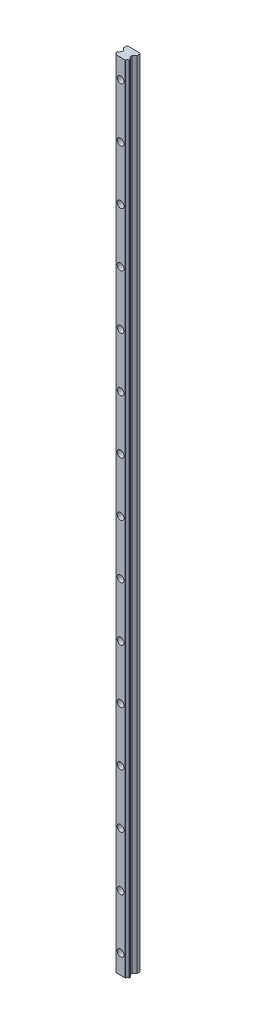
ISO-10303-21;
HEADER;
FILE_DESCRIPTION(('STEP AP214'),'2;1');
FILE_NAME('part.step','',(''),(''),'','','');
FILE_SCHEMA(('AUTOMOTIVE_DESIGN { 1 0 10303 214 1 1 1 1 }'));
ENDSEC;
DATA;
#1=APPLICATION_CONTEXT('core data for automotive mechanical design processes');
#2=APPLICATION_PROTOCOL_DEFINITION('international standard','automotive_design',2000,#1);
#3=PRODUCT_CONTEXT('',#1,'mechanical');
#4=PRODUCT('Part','Part','',(#3));
#5=PRODUCT_RELATED_PRODUCT_CATEGORY('part','',(#4));
#6=PRODUCT_DEFINITION_FORMATION('','',#4);
#7=PRODUCT_DEFINITION_CONTEXT('part definition',#1,'design');
#8=PRODUCT_DEFINITION('design','',#6,#7);
#9=PRODUCT_DEFINITION_SHAPE('','',#8);
#10=(LENGTH_UNIT() NAMED_UNIT(*) SI_UNIT(.MILLI.,.METRE.));
#11=(NAMED_UNIT(*) PLANE_ANGLE_UNIT() SI_UNIT($,.RADIAN.));
#12=(NAMED_UNIT(*) SI_UNIT($,.STERADIAN.) SOLID_ANGLE_UNIT());
#13=UNCERTAINTY_MEASURE_WITH_UNIT(LENGTH_MEASURE(1.E-05),#10,'distance_accuracy_value','');
#14=(GEOMETRIC_REPRESENTATION_CONTEXT(3) GLOBAL_UNCERTAINTY_ASSIGNED_CONTEXT((#13)) GLOBAL_UNIT_ASSIGNED_CONTEXT((#10,
#11,#12)) REPRESENTATION_CONTEXT('',''));
#15=CARTESIAN_POINT('',(0.,0.,0.));
#16=DIRECTION('',(0.,0.,1.));
#17=DIRECTION('',(1.,0.,0.));
#18=AXIS2_PLACEMENT_3D('',#15,#16,#17);
#19=CARTESIAN_POINT('',(7.244901,-978.450092,-9.10500699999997));
#20=DIRECTION('',(0.,1.,0.));
#21=DIRECTION('',(0.,0.,1.));
#22=AXIS2_PLACEMENT_3D('',#19,#20,#21);
#23=CYLINDRICAL_SURFACE('',#22,1.79999999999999);
#24=CARTESIAN_POINT('',(7.244901,-95.450092,-9.10500699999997));
#25=DIRECTION('',(0.,1.,0.));
#26=DIRECTION('',(0.,0.,-1.));
#27=AXIS2_PLACEMENT_3D('',#24,#25,#26);
#28=CIRCLE('',#27,1.79999999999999);
#29=CARTESIAN_POINT('',(7.15379670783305,-95.450092,-10.9026999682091));
#30=VERTEX_POINT('',#29);
#31=CARTESIAN_POINT('',(5.44720801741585,-95.450092,-9.19611100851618));
#32=VERTEX_POINT('',#31);
#33=EDGE_CURVE('E235',#30,#32,#28,.T.);
#34=ORIENTED_EDGE('',*,*,#33,.T.);
#35=DIRECTION('',(0.,1.,0.));
#36=VECTOR('',#35,1.);
#37=CARTESIAN_POINT('',(5.44720801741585,-978.450092,-9.19611100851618));
#38=LINE('',#37,#36);
#39=CARTESIAN_POINT('',(5.44720801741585,-978.450092,-9.19611100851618));
#40=VERTEX_POINT('',#39);
#41=EDGE_CURVE('E11',#40,#32,#38,.T.);
#42=ORIENTED_EDGE('',*,*,#41,.F.);
#43=CARTESIAN_POINT('',(7.244901,-978.450092,-9.10500699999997));
#44=DIRECTION('',(0.,1.,0.));
#45=DIRECTION('',(0.,0.,-1.));
#46=AXIS2_PLACEMENT_3D('',#43,#44,#45);
#47=CIRCLE('',#46,1.79999999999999);
#48=CARTESIAN_POINT('',(7.15379670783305,-978.450092,-10.9026999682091));
#49=VERTEX_POINT('',#48);
#50=EDGE_CURVE('E282',#49,#40,#47,.T.);
#51=ORIENTED_EDGE('',*,*,#50,.F.);
#52=DIRECTION('',(0.,1.,0.));
#53=VECTOR('',#52,1.);
#54=CARTESIAN_POINT('',(7.15379670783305,-978.450092,-10.9026999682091));
#55=LINE('',#54,#53);
#56=EDGE_CURVE('E231',#49,#30,#55,.T.);
#57=ORIENTED_EDGE('',*,*,#56,.T.);
#58=EDGE_LOOP('',(#34,#42,#51,#57));
#59=FACE_BOUND('',#58,.T.);
#60=ADVANCED_FACE('F43',(#59),#23,.F.);
#61=CARTESIAN_POINT('',(5.44720801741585,-978.450092,-9.19611100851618));
#62=DIRECTION('',(-0.707106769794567,0.,-0.707106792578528));
#63=DIRECTION('',(-0.707106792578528,0.,0.707106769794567));
#64=AXIS2_PLACEMENT_3D('',#61,#62,#63);
#65=PLANE('',#64);
#66=DIRECTION('',(-0.707106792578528,0.,0.707106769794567));
#67=VECTOR('',#66,1.);
#68=CARTESIAN_POINT('',(5.44720801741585,-95.450092,-9.19611100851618));
#69=LINE('',#68,#67);
#70=CARTESIAN_POINT('',(5.171005,-95.450092,-8.91990799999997));
#71=VERTEX_POINT('',#70);
#72=EDGE_CURVE('E238',#32,#71,#69,.T.);
#73=ORIENTED_EDGE('',*,*,#72,.T.);
#74=DIRECTION('',(0.,1.,0.));
#75=VECTOR('',#74,1.);
#76=CARTESIAN_POINT('',(5.171005,-978.450092,-8.91990799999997));
#77=LINE('',#76,#75);
#78=CARTESIAN_POINT('',(5.171005,-978.450092,-8.91990799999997));
#79=VERTEX_POINT('',#78);
#80=EDGE_CURVE('E51',#79,#71,#77,.T.);
#81=ORIENTED_EDGE('',*,*,#80,.F.);
#82=DIRECTION('',(-0.707106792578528,0.,0.707106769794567));
#83=VECTOR('',#82,1.);
#84=CARTESIAN_POINT('',(5.44720801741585,-978.450092,-9.19611100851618));
#85=LINE('',#84,#83);
#86=EDGE_CURVE('E150',#40,#79,#85,.T.);
#87=ORIENTED_EDGE('',*,*,#86,.F.);
#88=ORIENTED_EDGE('',*,*,#41,.T.);
#89=EDGE_LOOP('',(#73,#81,#87,#88));
#90=FACE_BOUND('',#89,.T.);
#91=ADVANCED_FACE('F420',(#90),#65,.F.);
#92=CARTESIAN_POINT('',(5.171005,-978.450092,-8.91990799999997));
#93=DIRECTION('',(0.,0.,-1.));
#94=DIRECTION('',(-1.,0.,0.));
#95=AXIS2_PLACEMENT_3D('',#92,#93,#94);
#96=PLANE('',#95);
#97=CARTESIAN_POINT('',(0.,-116.950092,-8.91990799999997));
#98=DIRECTION('',(0.,0.,1.));
#99=DIRECTION('',(1.,0.,0.));
#100=AXIS2_PLACEMENT_3D('',#97,#98,#99);
#101=CIRCLE('',#100,3.75);
#102=CARTESIAN_POINT('',(3.75,-116.950092,-8.91990799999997));
#103=VERTEX_POINT('',#102);
#104=EDGE_CURVE('E996',#103,#103,#101,.T.);
#105=ORIENTED_EDGE('',*,*,#104,.F.);
#106=EDGE_LOOP('',(#105));
#107=FACE_BOUND('',#106,.T.);
#108=CARTESIAN_POINT('',(0.,-176.950092,-8.91990799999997));
#109=DIRECTION('',(0.,0.,1.));
#110=DIRECTION('',(1.,0.,0.));
#111=AXIS2_PLACEMENT_3D('',#108,#109,#110);
#112=CIRCLE('',#111,3.75);
#113=CARTESIAN_POINT('',(3.75,-176.950092,-8.91990799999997));
#114=VERTEX_POINT('',#113);
#115=EDGE_CURVE('E1006',#114,#114,#112,.T.);
#116=ORIENTED_EDGE('',*,*,#115,.F.);
#117=EDGE_LOOP('',(#116));
#118=FACE_BOUND('',#117,.T.);
#119=CARTESIAN_POINT('',(0.,-236.950092,-8.91990799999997));
#120=DIRECTION('',(0.,0.,1.));
#121=DIRECTION('',(1.,0.,0.));
#122=AXIS2_PLACEMENT_3D('',#119,#120,#121);
#123=CIRCLE('',#122,3.75);
#124=CARTESIAN_POINT('',(3.75,-236.950092,-8.91990799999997));
#125=VERTEX_POINT('',#124);
#126=EDGE_CURVE('E1018',#125,#125,#123,.T.);
#127=ORIENTED_EDGE('',*,*,#126,.F.);
#128=EDGE_LOOP('',(#127));
#129=FACE_BOUND('',#128,.T.);
#130=CARTESIAN_POINT('',(0.,-296.950092,-8.91990799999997));
#131=DIRECTION('',(0.,0.,1.));
#132=DIRECTION('',(1.,0.,0.));
#133=AXIS2_PLACEMENT_3D('',#130,#131,#132);
#134=CIRCLE('',#133,3.75);
#135=CARTESIAN_POINT('',(3.75,-296.950092,-8.91990799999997));
#136=VERTEX_POINT('',#135);
#137=EDGE_CURVE('E1030',#136,#136,#134,.T.);
#138=ORIENTED_EDGE('',*,*,#137,.F.);
#139=EDGE_LOOP('',(#138));
#140=FACE_BOUND('',#139,.T.);
#141=CARTESIAN_POINT('',(0.,-356.950092,-8.91990799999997));
#142=DIRECTION('',(0.,0.,1.));
#143=DIRECTION('',(1.,0.,0.));
#144=AXIS2_PLACEMENT_3D('',#141,#142,#143);
#145=CIRCLE('',#144,3.75);
#146=CARTESIAN_POINT('',(3.75,-356.950092,-8.91990799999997));
#147=VERTEX_POINT('',#146);
#148=EDGE_CURVE('E1042',#147,#147,#145,.T.);
#149=ORIENTED_EDGE('',*,*,#148,.F.);
#150=EDGE_LOOP('',(#149));
#151=FACE_BOUND('',#150,.T.);
#152=CARTESIAN_POINT('',(0.,-416.950092,-8.91990799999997));
#153=DIRECTION('',(0.,0.,1.));
#154=DIRECTION('',(1.,0.,0.));
#155=AXIS2_PLACEMENT_3D('',#152,#153,#154);
#156=CIRCLE('',#155,3.75);
#157=CARTESIAN_POINT('',(3.75,-416.950092,-8.91990799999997));
#158=VERTEX_POINT('',#157);
#159=EDGE_CURVE('E1054',#158,#158,#156,.T.);
#160=ORIENTED_EDGE('',*,*,#159,.F.);
#161=EDGE_LOOP('',(#160));
#162=FACE_BOUND('',#161,.T.);
#163=CARTESIAN_POINT('',(0.,-476.950092,-8.91990799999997));
#164=DIRECTION('',(0.,0.,1.));
#165=DIRECTION('',(1.,0.,0.));
#166=AXIS2_PLACEMENT_3D('',#163,#164,#165);
#167=CIRCLE('',#166,3.75);
#168=CARTESIAN_POINT('',(3.75,-476.950092,-8.91990799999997));
#169=VERTEX_POINT('',#168);
#170=EDGE_CURVE('E1066',#169,#169,#167,.T.);
#171=ORIENTED_EDGE('',*,*,#170,.F.);
#172=EDGE_LOOP('',(#171));
#173=FACE_BOUND('',#172,.T.);
#174=CARTESIAN_POINT('',(0.,-536.950092,-8.91990799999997));
#175=DIRECTION('',(0.,0.,1.));
#176=DIRECTION('',(1.,0.,0.));
#177=AXIS2_PLACEMENT_3D('',#174,#175,#176);
#178=CIRCLE('',#177,3.75);
#179=CARTESIAN_POINT('',(3.75,-536.950092,-8.91990799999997));
#180=VERTEX_POINT('',#179);
#181=EDGE_CURVE('E1078',#180,#180,#178,.T.);
#182=ORIENTED_EDGE('',*,*,#181,.F.);
#183=EDGE_LOOP('',(#182));
#184=FACE_BOUND('',#183,.T.);
#185=CARTESIAN_POINT('',(0.,-596.950092,-8.91990799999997));
#186=DIRECTION('',(0.,0.,1.));
#187=DIRECTION('',(1.,0.,0.));
#188=AXIS2_PLACEMENT_3D('',#185,#186,#187);
#189=CIRCLE('',#188,3.75);
#190=CARTESIAN_POINT('',(3.75,-596.950092,-8.91990799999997));
#191=VERTEX_POINT('',#190);
#192=EDGE_CURVE('E1090',#191,#191,#189,.T.);
#193=ORIENTED_EDGE('',*,*,#192,.F.);
#194=EDGE_LOOP('',(#193));
#195=FACE_BOUND('',#194,.T.);
#196=CARTESIAN_POINT('',(0.,-656.950092,-8.91990799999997));
#197=DIRECTION('',(0.,0.,1.));
#198=DIRECTION('',(1.,0.,0.));
#199=AXIS2_PLACEMENT_3D('',#196,#197,#198);
#200=CIRCLE('',#199,3.75);
#201=CARTESIAN_POINT('',(3.75,-656.950092,-8.91990799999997));
#202=VERTEX_POINT('',#201);
#203=EDGE_CURVE('E1102',#202,#202,#200,.T.);
#204=ORIENTED_EDGE('',*,*,#203,.F.);
#205=EDGE_LOOP('',(#204));
#206=FACE_BOUND('',#205,.T.);
#207=CARTESIAN_POINT('',(0.,-716.950091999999,-8.91990799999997));
#208=DIRECTION('',(0.,0.,1.));
#209=DIRECTION('',(1.,0.,0.));
#210=AXIS2_PLACEMENT_3D('',#207,#208,#209);
#211=CIRCLE('',#210,3.75);
#212=CARTESIAN_POINT('',(3.75,-716.950091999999,-8.91990799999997));
#213=VERTEX_POINT('',#212);
#214=EDGE_CURVE('E1114',#213,#213,#211,.T.);
#215=ORIENTED_EDGE('',*,*,#214,.F.);
#216=EDGE_LOOP('',(#215));
#217=FACE_BOUND('',#216,.T.);
#218=CARTESIAN_POINT('',(0.,-776.950091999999,-8.91990799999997));
#219=DIRECTION('',(0.,0.,1.));
#220=DIRECTION('',(1.,0.,0.));
#221=AXIS2_PLACEMENT_3D('',#218,#219,#220);
#222=CIRCLE('',#221,3.75);
#223=CARTESIAN_POINT('',(3.75,-776.950091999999,-8.91990799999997));
#224=VERTEX_POINT('',#223);
#225=EDGE_CURVE('E1126',#224,#224,#222,.T.);
#226=ORIENTED_EDGE('',*,*,#225,.F.);
#227=EDGE_LOOP('',(#226));
#228=FACE_BOUND('',#227,.T.);
#229=CARTESIAN_POINT('',(0.,-836.950091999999,-8.91990799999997));
#230=DIRECTION('',(0.,0.,1.));
#231=DIRECTION('',(1.,0.,0.));
#232=AXIS2_PLACEMENT_3D('',#229,#230,#231);
#233=CIRCLE('',#232,3.75);
#234=CARTESIAN_POINT('',(3.75,-836.950091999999,-8.91990799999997));
#235=VERTEX_POINT('',#234);
#236=EDGE_CURVE('E1138',#235,#235,#233,.T.);
#237=ORIENTED_EDGE('',*,*,#236,.F.);
#238=EDGE_LOOP('',(#237));
#239=FACE_BOUND('',#238,.T.);
#240=CARTESIAN_POINT('',(0.,-896.950091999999,-8.91990799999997));
#241=DIRECTION('',(0.,0.,1.));
#242=DIRECTION('',(1.,0.,0.));
#243=AXIS2_PLACEMENT_3D('',#240,#241,#242);
#244=CIRCLE('',#243,3.75);
#245=CARTESIAN_POINT('',(3.75,-896.950091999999,-8.91990799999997));
#246=VERTEX_POINT('',#245);
#247=EDGE_CURVE('E1150',#246,#246,#244,.T.);
#248=ORIENTED_EDGE('',*,*,#247,.F.);
#249=EDGE_LOOP('',(#248));
#250=FACE_BOUND('',#249,.T.);
#251=CARTESIAN_POINT('',(0.,-956.950091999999,-8.91990799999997));
#252=DIRECTION('',(0.,0.,1.));
#253=DIRECTION('',(1.,0.,0.));
#254=AXIS2_PLACEMENT_3D('',#251,#252,#253);
#255=CIRCLE('',#254,3.75);
#256=CARTESIAN_POINT('',(3.75,-956.950091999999,-8.91990799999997));
#257=VERTEX_POINT('',#256);
#258=EDGE_CURVE('E1162',#257,#257,#255,.T.);
#259=ORIENTED_EDGE('',*,*,#258,.F.);
#260=EDGE_LOOP('',(#259));
#261=FACE_BOUND('',#260,.T.);
#262=DIRECTION('',(-1.,0.,0.));
#263=VECTOR('',#262,1.);
#264=CARTESIAN_POINT('',(5.171005,-95.450092,-8.91990799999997));
#265=LINE('',#264,#263);
#266=CARTESIAN_POINT('',(-5.171005,-95.450092,-8.91990799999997));
#267=VERTEX_POINT('',#266);
#268=EDGE_CURVE('E241',#71,#267,#265,.T.);
#269=ORIENTED_EDGE('',*,*,#268,.T.);
#270=DIRECTION('',(0.,1.,0.));
#271=VECTOR('',#270,1.);
#272=CARTESIAN_POINT('',(-5.171005,-978.450092,-8.91990799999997));
#273=LINE('',#272,#271);
#274=CARTESIAN_POINT('',(-5.171005,-978.450092,-8.91990799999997));
#275=VERTEX_POINT('',#274);
#276=EDGE_CURVE('E337',#275,#267,#273,.T.);
#277=ORIENTED_EDGE('',*,*,#276,.F.);
#278=DIRECTION('',(-1.,0.,0.));
#279=VECTOR('',#278,1.);
#280=CARTESIAN_POINT('',(5.171005,-978.450092,-8.91990799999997));
#281=LINE('',#280,#279);
#282=EDGE_CURVE('E345',#79,#275,#281,.T.);
#283=ORIENTED_EDGE('',*,*,#282,.F.);
#284=ORIENTED_EDGE('',*,*,#80,.T.);
#285=EDGE_LOOP('',(#269,#277,#283,#284));
#286=FACE_BOUND('',#285,.T.);
#287=ADVANCED_FACE('F343',(#107,#118,#129,#140,#151,#162,#173,#184,#195,#206,#217,#228,#239,
#250,#261,#286),#96,.F.);
#288=CARTESIAN_POINT('',(-5.171005,-978.450092,-8.91990799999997));
#289=DIRECTION('',(0.707107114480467,0.,-0.707106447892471));
#290=DIRECTION('',(-0.707106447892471,0.,-0.707107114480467));
#291=AXIS2_PLACEMENT_3D('',#288,#289,#290);
#292=PLANE('',#291);
#293=DIRECTION('',(-0.707106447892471,0.,-0.707107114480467));
#294=VECTOR('',#293,1.);
#295=CARTESIAN_POINT('',(-5.171005,-95.450092,-8.91990799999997));
#296=LINE('',#295,#294);
#297=CARTESIAN_POINT('',(-5.44720803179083,-95.450092,-9.19611129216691));
#298=VERTEX_POINT('',#297);
#299=EDGE_CURVE('E243',#267,#298,#296,.T.);
#300=ORIENTED_EDGE('',*,*,#299,.T.);
#301=DIRECTION('',(0.,1.,0.));
#302=VECTOR('',#301,1.);
#303=CARTESIAN_POINT('',(-5.44720803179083,-978.450092,-9.19611129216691));
#304=LINE('',#303,#302);
#305=CARTESIAN_POINT('',(-5.44720803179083,-978.450092,-9.19611129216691));
#306=VERTEX_POINT('',#305);
#307=EDGE_CURVE('E334',#306,#298,#304,.T.);
#308=ORIENTED_EDGE('',*,*,#307,.F.);
#309=DIRECTION('',(-0.707106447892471,0.,-0.707107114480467));
#310=VECTOR('',#309,1.);
#311=CARTESIAN_POINT('',(-5.171005,-978.450092,-8.91990799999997));
#312=LINE('',#311,#310);
#313=EDGE_CURVE('E363',#275,#306,#312,.T.);
#314=ORIENTED_EDGE('',*,*,#313,.F.);
#315=ORIENTED_EDGE('',*,*,#276,.T.);
#316=EDGE_LOOP('',(#300,#308,#314,#315));
#317=FACE_BOUND('',#316,.T.);
#318=ADVANCED_FACE('F354',(#317),#292,.F.);
#319=CARTESIAN_POINT('',(-7.244901,-978.450092,-9.10500699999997));
#320=DIRECTION('',(0.,1.,0.));
#321=DIRECTION('',(0.,0.,1.));
#322=AXIS2_PLACEMENT_3D('',#319,#320,#321);
#323=CYLINDRICAL_SURFACE('',#322,1.79999999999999);
#324=CARTESIAN_POINT('',(-7.244901,-95.450092,-9.10500699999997));
#325=DIRECTION('',(0.,1.,0.));
#326=DIRECTION('',(0.,0.,-1.));
#327=AXIS2_PLACEMENT_3D('',#324,#325,#326);
#328=CIRCLE('',#327,1.79999999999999);
#329=CARTESIAN_POINT('',(-7.15379699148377,-95.450092,-10.9026999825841));
#330=VERTEX_POINT('',#329);
#331=EDGE_CURVE('E245',#298,#330,#328,.T.);
#332=ORIENTED_EDGE('',*,*,#331,.T.);
#333=DIRECTION('',(0.,1.,0.));
#334=VECTOR('',#333,1.);
#335=CARTESIAN_POINT('',(-7.15379699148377,-978.450092,-10.9026999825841));
#336=LINE('',#335,#334);
#337=CARTESIAN_POINT('',(-7.15379699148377,-978.450092,-10.9026999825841));
#338=VERTEX_POINT('',#337);
#339=EDGE_CURVE('E331',#338,#330,#336,.T.);
#340=ORIENTED_EDGE('',*,*,#339,.F.);
#341=CARTESIAN_POINT('',(-7.244901,-978.450092,-9.10500699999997));
#342=DIRECTION('',(0.,1.,0.));
#343=DIRECTION('',(0.,0.,-1.));
#344=AXIS2_PLACEMENT_3D('',#341,#342,#343);
#345=CIRCLE('',#344,1.79999999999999);
#346=EDGE_CURVE('E360',#306,#338,#345,.T.);
#347=ORIENTED_EDGE('',*,*,#346,.F.);
#348=ORIENTED_EDGE('',*,*,#307,.T.);
#349=EDGE_LOOP('',(#332,#340,#347,#348));
#350=FACE_BOUND('',#349,.T.);
#351=ADVANCED_FACE('F358',(#350),#323,.F.);
#352=CARTESIAN_POINT('',(-7.15379699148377,-978.450092,-10.9026999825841));
#353=DIRECTION('',(0.707106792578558,0.,-0.707106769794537));
#354=DIRECTION('',(-0.707106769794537,0.,-0.707106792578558));
#355=AXIS2_PLACEMENT_3D('',#352,#353,#354);
#356=PLANE('',#355);
#357=DIRECTION('',(-0.707106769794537,0.,-0.707106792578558));
#358=VECTOR('',#357,1.);
#359=CARTESIAN_POINT('',(-7.15379699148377,-95.450092,-10.9026999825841));
#360=LINE('',#359,#358);
#361=CARTESIAN_POINT('',(-7.43,-95.450092,-11.178903));
#362=VERTEX_POINT('',#361);
#363=EDGE_CURVE('E247',#330,#362,#360,.T.);
#364=ORIENTED_EDGE('',*,*,#363,.T.);
#365=DIRECTION('',(0.,1.,0.));
#366=VECTOR('',#365,1.);
#367=CARTESIAN_POINT('',(-7.43,-978.450092,-11.178903));
#368=LINE('',#367,#366);
#369=CARTESIAN_POINT('',(-7.43,-978.450092,-11.178903));
#370=VERTEX_POINT('',#369);
#371=EDGE_CURVE('E328',#370,#362,#368,.T.);
#372=ORIENTED_EDGE('',*,*,#371,.F.);
#373=DIRECTION('',(-0.707106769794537,0.,-0.707106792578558));
#374=VECTOR('',#373,1.);
#375=CARTESIAN_POINT('',(-7.15379699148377,-978.450092,-10.9026999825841));
#376=LINE('',#375,#374);
#377=EDGE_CURVE('E362',#338,#370,#376,.T.);
#378=ORIENTED_EDGE('',*,*,#377,.F.);
#379=ORIENTED_EDGE('',*,*,#339,.T.);
#380=EDGE_LOOP('',(#364,#372,#378,#379));
#381=FACE_BOUND('',#380,.T.);
#382=ADVANCED_FACE('F434',(#381),#356,.F.);
#383=CARTESIAN_POINT('',(-7.43,-978.450092,-11.178903));
#384=DIRECTION('',(1.,0.,0.));
#385=DIRECTION('',(0.,0.,-1.));
#386=AXIS2_PLACEMENT_3D('',#383,#384,#385);
#387=PLANE('',#386);
#388=DIRECTION('',(0.,0.,-1.));
#389=VECTOR('',#388,1.);
#390=CARTESIAN_POINT('',(-7.43,-95.450092,-11.178903));
#391=LINE('',#390,#389);
#392=CARTESIAN_POINT('',(-7.43,-95.450092,-12.320913));
#393=VERTEX_POINT('',#392);
#394=EDGE_CURVE('E249',#362,#393,#391,.T.);
#395=ORIENTED_EDGE('',*,*,#394,.T.);
#396=DIRECTION('',(0.,1.,0.));
#397=VECTOR('',#396,1.);
#398=CARTESIAN_POINT('',(-7.43,-978.450092,-12.320913));
#399=LINE('',#398,#397);
#400=CARTESIAN_POINT('',(-7.43,-978.450092,-12.320913));
#401=VERTEX_POINT('',#400);
#402=EDGE_CURVE('E325',#401,#393,#399,.T.);
#403=ORIENTED_EDGE('',*,*,#402,.F.);
#404=DIRECTION('',(0.,0.,-1.));
#405=VECTOR('',#404,1.);
#406=CARTESIAN_POINT('',(-7.43,-978.450092,-11.178903));
#407=LINE('',#406,#405);
#408=EDGE_CURVE('E365',#370,#401,#407,.T.);
#409=ORIENTED_EDGE('',*,*,#408,.F.);
#410=ORIENTED_EDGE('',*,*,#371,.T.);
#411=EDGE_LOOP('',(#395,#403,#409,#410));
#412=FACE_BOUND('',#411,.T.);
#413=ADVANCED_FACE('F437',(#412),#387,.F.);
#414=CARTESIAN_POINT('',(-7.43,-978.450092,-12.320913));
#415=DIRECTION('',(0.70710644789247,0.,0.707107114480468));
#416=DIRECTION('',(0.707107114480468,0.,-0.70710644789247));
#417=AXIS2_PLACEMENT_3D('',#414,#415,#416);
#418=PLANE('',#417);
#419=DIRECTION('',(0.707107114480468,0.,-0.70710644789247));
#420=VECTOR('',#419,1.);
#421=CARTESIAN_POINT('',(-7.43,-95.450092,-12.320913));
#422=LINE('',#421,#420);
#423=CARTESIAN_POINT('',(-7.15379670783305,-95.450092,-12.5971160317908));
#424=VERTEX_POINT('',#423);
#425=EDGE_CURVE('E251',#393,#424,#422,.T.);
#426=ORIENTED_EDGE('',*,*,#425,.T.);
#427=DIRECTION('',(0.,1.,0.));
#428=VECTOR('',#427,1.);
#429=CARTESIAN_POINT('',(-7.15379670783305,-978.450092,-12.5971160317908));
#430=LINE('',#429,#428);
#431=CARTESIAN_POINT('',(-7.15379670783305,-978.450092,-12.5971160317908));
#432=VERTEX_POINT('',#431);
#433=EDGE_CURVE('E322',#432,#424,#430,.T.);
#434=ORIENTED_EDGE('',*,*,#433,.F.);
#435=DIRECTION('',(0.707107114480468,0.,-0.70710644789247));
#436=VECTOR('',#435,1.);
#437=CARTESIAN_POINT('',(-7.43,-978.450092,-12.320913));
#438=LINE('',#437,#436);
#439=EDGE_CURVE('E371',#401,#432,#438,.T.);
#440=ORIENTED_EDGE('',*,*,#439,.F.);
#441=ORIENTED_EDGE('',*,*,#402,.T.);
#442=EDGE_LOOP('',(#426,#434,#440,#441));
#443=FACE_BOUND('',#442,.T.);
#444=ADVANCED_FACE('F441',(#443),#418,.F.);
#445=CARTESIAN_POINT('',(-7.244901,-978.450092,-14.394809));
#446=DIRECTION('',(0.,1.,0.));
#447=DIRECTION('',(0.,0.,1.));
#448=AXIS2_PLACEMENT_3D('',#445,#446,#447);
#449=CYLINDRICAL_SURFACE('',#448,1.79999999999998);
#450=CARTESIAN_POINT('',(-7.244901,-95.450092,-14.394809));
#451=DIRECTION('',(0.,1.,0.));
#452=DIRECTION('',(0.,0.,-1.));
#453=AXIS2_PLACEMENT_3D('',#450,#451,#452);
#454=CIRCLE('',#453,1.79999999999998);
#455=CARTESIAN_POINT('',(-5.44720801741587,-95.450092,-14.3037049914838));
#456=VERTEX_POINT('',#455);
#457=EDGE_CURVE('E253',#424,#456,#454,.T.);
#458=ORIENTED_EDGE('',*,*,#457,.T.);
#459=DIRECTION('',(0.,1.,0.));
#460=VECTOR('',#459,1.);
#461=CARTESIAN_POINT('',(-5.44720801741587,-978.450092,-14.3037049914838));
#462=LINE('',#461,#460);
#463=CARTESIAN_POINT('',(-5.44720801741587,-978.450092,-14.3037049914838));
#464=VERTEX_POINT('',#463);
#465=EDGE_CURVE('E319',#464,#456,#462,.T.);
#466=ORIENTED_EDGE('',*,*,#465,.F.);
#467=CARTESIAN_POINT('',(-7.244901,-978.450092,-14.394809));
#468=DIRECTION('',(0.,1.,0.));
#469=DIRECTION('',(0.,0.,-1.));
#470=AXIS2_PLACEMENT_3D('',#467,#468,#469);
#471=CIRCLE('',#470,1.79999999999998);
#472=EDGE_CURVE('E373',#432,#464,#471,.T.);
#473=ORIENTED_EDGE('',*,*,#472,.F.);
#474=ORIENTED_EDGE('',*,*,#433,.T.);
#475=EDGE_LOOP('',(#458,#466,#473,#474));
#476=FACE_BOUND('',#475,.T.);
#477=ADVANCED_FACE('F445',(#476),#449,.F.);
#478=CARTESIAN_POINT('',(-5.44720801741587,-978.450092,-14.3037049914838));
#479=DIRECTION('',(0.707106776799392,0.,0.707106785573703));
#480=DIRECTION('',(0.707106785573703,0.,-0.707106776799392));
#481=AXIS2_PLACEMENT_3D('',#478,#479,#480);
#482=PLANE('',#481);
#483=DIRECTION('',(0.707106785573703,0.,-0.707106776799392));
#484=VECTOR('',#483,1.);
#485=CARTESIAN_POINT('',(-5.44720801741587,-95.450092,-14.3037049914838));
#486=LINE('',#485,#484);
#487=CARTESIAN_POINT('',(-4.73,-95.450092,-15.020913));
#488=VERTEX_POINT('',#487);
#489=EDGE_CURVE('E255',#456,#488,#486,.T.);
#490=ORIENTED_EDGE('',*,*,#489,.T.);
#491=DIRECTION('',(0.,1.,0.));
#492=VECTOR('',#491,1.);
#493=CARTESIAN_POINT('',(-4.73,-978.450092,-15.020913));
#494=LINE('',#493,#492);
#495=CARTESIAN_POINT('',(-4.73,-978.450092,-15.020913));
#496=VERTEX_POINT('',#495);
#497=EDGE_CURVE('E316',#496,#488,#494,.T.);
#498=ORIENTED_EDGE('',*,*,#497,.F.);
#499=DIRECTION('',(0.707106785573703,0.,-0.707106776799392));
#500=VECTOR('',#499,1.);
#501=CARTESIAN_POINT('',(-5.44720801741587,-978.450092,-14.3037049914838));
#502=LINE('',#501,#500);
#503=EDGE_CURVE('E375',#464,#496,#502,.T.);
#504=ORIENTED_EDGE('',*,*,#503,.F.);
#505=ORIENTED_EDGE('',*,*,#465,.T.);
#506=EDGE_LOOP('',(#490,#498,#504,#505));
#507=FACE_BOUND('',#506,.T.);
#508=ADVANCED_FACE('F449',(#507),#482,.F.);
#509=CARTESIAN_POINT('',(-4.73,-978.450092,-15.020913));
#510=DIRECTION('',(1.,0.,0.));
#511=DIRECTION('',(0.,0.,-1.));
#512=AXIS2_PLACEMENT_3D('',#509,#510,#511);
#513=PLANE('',#512);
#514=DIRECTION('',(0.,0.,-1.));
#515=VECTOR('',#514,1.);
#516=CARTESIAN_POINT('',(-4.73,-95.450092,-15.020913));
#517=LINE('',#516,#515);
#518=CARTESIAN_POINT('',(-4.73,-95.450092,-16.978903));
#519=VERTEX_POINT('',#518);
#520=EDGE_CURVE('E257',#488,#519,#517,.T.);
#521=ORIENTED_EDGE('',*,*,#520,.T.);
#522=DIRECTION('',(0.,1.,0.));
#523=VECTOR('',#522,1.);
#524=CARTESIAN_POINT('',(-4.73,-978.450092,-16.978903));
#525=LINE('',#524,#523);
#526=CARTESIAN_POINT('',(-4.73,-978.450092,-16.978903));
#527=VERTEX_POINT('',#526);
#528=EDGE_CURVE('E313',#527,#519,#525,.T.);
#529=ORIENTED_EDGE('',*,*,#528,.F.);
#530=DIRECTION('',(0.,0.,-1.));
#531=VECTOR('',#530,1.);
#532=CARTESIAN_POINT('',(-4.73,-978.450092,-15.020913));
#533=LINE('',#532,#531);
#534=EDGE_CURVE('E377',#496,#527,#533,.T.);
#535=ORIENTED_EDGE('',*,*,#534,.F.);
#536=ORIENTED_EDGE('',*,*,#497,.T.);
#537=EDGE_LOOP('',(#521,#529,#535,#536));
#538=FACE_BOUND('',#537,.T.);
#539=ADVANCED_FACE('F453',(#538),#513,.F.);
#540=CARTESIAN_POINT('',(-4.73,-978.450092,-16.978903));
#541=DIRECTION('',(0.707106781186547,0.,-0.707106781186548));
#542=DIRECTION('',(-0.707106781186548,0.,-0.707106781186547));
#543=AXIS2_PLACEMENT_3D('',#540,#541,#542);
#544=PLANE('',#543);
#545=DIRECTION('',(-0.707106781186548,0.,-0.707106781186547));
#546=VECTOR('',#545,1.);
#547=CARTESIAN_POINT('',(-4.73,-95.450092,-16.978903));
#548=LINE('',#547,#546);
#549=CARTESIAN_POINT('',(-7.5,-95.450092,-19.748903));
#550=VERTEX_POINT('',#549);
#551=EDGE_CURVE('E259',#519,#550,#548,.T.);
#552=ORIENTED_EDGE('',*,*,#551,.T.);
#553=DIRECTION('',(0.,1.,0.));
#554=VECTOR('',#553,1.);
#555=CARTESIAN_POINT('',(-7.5,-978.450092,-19.748903));
#556=LINE('',#555,#554);
#557=CARTESIAN_POINT('',(-7.5,-978.450092,-19.748903));
#558=VERTEX_POINT('',#557);
#559=EDGE_CURVE('E310',#558,#550,#556,.T.);
#560=ORIENTED_EDGE('',*,*,#559,.F.);
#561=DIRECTION('',(-0.707106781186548,0.,-0.707106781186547));
#562=VECTOR('',#561,1.);
#563=CARTESIAN_POINT('',(-4.73,-978.450092,-16.978903));
#564=LINE('',#563,#562);
#565=EDGE_CURVE('E379',#527,#558,#564,.T.);
#566=ORIENTED_EDGE('',*,*,#565,.F.);
#567=ORIENTED_EDGE('',*,*,#528,.T.);
#568=EDGE_LOOP('',(#552,#560,#566,#567));
#569=FACE_BOUND('',#568,.T.);
#570=ADVANCED_FACE('F457',(#569),#544,.F.);
#571=CARTESIAN_POINT('',(-7.5,-978.450092,-19.748903));
#572=DIRECTION('',(1.,0.,0.));
#573=DIRECTION('',(0.,0.,-1.));
#574=AXIS2_PLACEMENT_3D('',#571,#572,#573);
#575=PLANE('',#574);
#576=DIRECTION('',(0.,0.,-1.));
#577=VECTOR('',#576,1.);
#578=CARTESIAN_POINT('',(-7.5,-95.450092,-19.748903));
#579=LINE('',#578,#577);
#580=CARTESIAN_POINT('',(-7.5,-95.450092,-23.149908));
#581=VERTEX_POINT('',#580);
#582=EDGE_CURVE('E261',#550,#581,#579,.T.);
#583=ORIENTED_EDGE('',*,*,#582,.T.);
#584=DIRECTION('',(0.,1.,0.));
#585=VECTOR('',#584,1.);
#586=CARTESIAN_POINT('',(-7.5,-978.450092,-23.149908));
#587=LINE('',#586,#585);
#588=CARTESIAN_POINT('',(-7.5,-978.450092,-23.149908));
#589=VERTEX_POINT('',#588);
#590=EDGE_CURVE('E307',#589,#581,#587,.T.);
#591=ORIENTED_EDGE('',*,*,#590,.F.);
#592=DIRECTION('',(0.,0.,-1.));
#593=VECTOR('',#592,1.);
#594=CARTESIAN_POINT('',(-7.5,-978.450092,-19.748903));
#595=LINE('',#594,#593);
#596=EDGE_CURVE('E381',#558,#589,#595,.T.);
#597=ORIENTED_EDGE('',*,*,#596,.F.);
#598=ORIENTED_EDGE('',*,*,#559,.T.);
#599=EDGE_LOOP('',(#583,#591,#597,#598));
#600=FACE_BOUND('',#599,.T.);
#601=ADVANCED_FACE('F461',(#600),#575,.F.);
#602=CARTESIAN_POINT('',(-7.5,-978.450092,-23.149908));
#603=DIRECTION('',(0.707106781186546,0.,0.707106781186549));
#604=DIRECTION('',(0.707106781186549,0.,-0.707106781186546));
#605=AXIS2_PLACEMENT_3D('',#602,#603,#604);
#606=PLANE('',#605);
#607=DIRECTION('',(0.707106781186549,0.,-0.707106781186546));
#608=VECTOR('',#607,1.);
#609=CARTESIAN_POINT('',(-7.5,-95.450092,-23.149908));
#610=LINE('',#609,#608);
#611=CARTESIAN_POINT('',(-6.8,-95.450092,-23.849908));
#612=VERTEX_POINT('',#611);
#613=EDGE_CURVE('E263',#581,#612,#610,.T.);
#614=ORIENTED_EDGE('',*,*,#613,.T.);
#615=DIRECTION('',(0.,1.,0.));
#616=VECTOR('',#615,1.);
#617=CARTESIAN_POINT('',(-6.8,-978.450092,-23.849908));
#618=LINE('',#617,#616);
#619=CARTESIAN_POINT('',(-6.8,-978.450092,-23.849908));
#620=VERTEX_POINT('',#619);
#621=EDGE_CURVE('E304',#620,#612,#618,.T.);
#622=ORIENTED_EDGE('',*,*,#621,.F.);
#623=DIRECTION('',(0.707106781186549,0.,-0.707106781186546));
#624=VECTOR('',#623,1.);
#625=CARTESIAN_POINT('',(-7.5,-978.450092,-23.149908));
#626=LINE('',#625,#624);
#627=EDGE_CURVE('E383',#589,#620,#626,.T.);
#628=ORIENTED_EDGE('',*,*,#627,.F.);
#629=ORIENTED_EDGE('',*,*,#590,.T.);
#630=EDGE_LOOP('',(#614,#622,#628,#629));
#631=FACE_BOUND('',#630,.T.);
#632=ADVANCED_FACE('F465',(#631),#606,.F.);
#633=CARTESIAN_POINT('',(-6.8,-978.450092,-23.849908));
#634=DIRECTION('',(0.,0.,1.));
#635=DIRECTION('',(1.,0.,0.));
#636=AXIS2_PLACEMENT_3D('',#633,#634,#635);
#637=PLANE('',#636);
#638=CARTESIAN_POINT('',(0.,-116.950092,-23.849908));
#639=DIRECTION('',(0.,0.,1.));
#640=DIRECTION('',(1.,0.,0.));
#641=AXIS2_PLACEMENT_3D('',#638,#639,#640);
#642=CIRCLE('',#641,2.25);
#643=CARTESIAN_POINT('',(2.25,-116.950092,-23.849908));
#644=VERTEX_POINT('',#643);
#645=EDGE_CURVE('E1003',#644,#644,#642,.T.);
#646=ORIENTED_EDGE('',*,*,#645,.T.);
#647=EDGE_LOOP('',(#646));
#648=FACE_BOUND('',#647,.T.);
#649=CARTESIAN_POINT('',(0.,-176.950092,-23.849908));
#650=DIRECTION('',(0.,0.,1.));
#651=DIRECTION('',(1.,0.,0.));
#652=AXIS2_PLACEMENT_3D('',#649,#650,#651);
#653=CIRCLE('',#652,2.25);
#654=CARTESIAN_POINT('',(2.25,-176.950092,-23.849908));
#655=VERTEX_POINT('',#654);
#656=EDGE_CURVE('E1015',#655,#655,#653,.T.);
#657=ORIENTED_EDGE('',*,*,#656,.T.);
#658=EDGE_LOOP('',(#657));
#659=FACE_BOUND('',#658,.T.);
#660=CARTESIAN_POINT('',(0.,-236.950092,-23.849908));
#661=DIRECTION('',(0.,0.,1.));
#662=DIRECTION('',(1.,0.,0.));
#663=AXIS2_PLACEMENT_3D('',#660,#661,#662);
#664=CIRCLE('',#663,2.25);
#665=CARTESIAN_POINT('',(2.25,-236.950092,-23.849908));
#666=VERTEX_POINT('',#665);
#667=EDGE_CURVE('E1027',#666,#666,#664,.T.);
#668=ORIENTED_EDGE('',*,*,#667,.T.);
#669=EDGE_LOOP('',(#668));
#670=FACE_BOUND('',#669,.T.);
#671=CARTESIAN_POINT('',(0.,-296.950092,-23.849908));
#672=DIRECTION('',(0.,0.,1.));
#673=DIRECTION('',(1.,0.,0.));
#674=AXIS2_PLACEMENT_3D('',#671,#672,#673);
#675=CIRCLE('',#674,2.25);
#676=CARTESIAN_POINT('',(2.25,-296.950092,-23.849908));
#677=VERTEX_POINT('',#676);
#678=EDGE_CURVE('E1039',#677,#677,#675,.T.);
#679=ORIENTED_EDGE('',*,*,#678,.T.);
#680=EDGE_LOOP('',(#679));
#681=FACE_BOUND('',#680,.T.);
#682=CARTESIAN_POINT('',(0.,-356.950092,-23.849908));
#683=DIRECTION('',(0.,0.,1.));
#684=DIRECTION('',(1.,0.,0.));
#685=AXIS2_PLACEMENT_3D('',#682,#683,#684);
#686=CIRCLE('',#685,2.25);
#687=CARTESIAN_POINT('',(2.25,-356.950092,-23.849908));
#688=VERTEX_POINT('',#687);
#689=EDGE_CURVE('E1051',#688,#688,#686,.T.);
#690=ORIENTED_EDGE('',*,*,#689,.T.);
#691=EDGE_LOOP('',(#690));
#692=FACE_BOUND('',#691,.T.);
#693=CARTESIAN_POINT('',(0.,-416.950092,-23.849908));
#694=DIRECTION('',(0.,0.,1.));
#695=DIRECTION('',(1.,0.,0.));
#696=AXIS2_PLACEMENT_3D('',#693,#694,#695);
#697=CIRCLE('',#696,2.25);
#698=CARTESIAN_POINT('',(2.25,-416.950092,-23.849908));
#699=VERTEX_POINT('',#698);
#700=EDGE_CURVE('E1063',#699,#699,#697,.T.);
#701=ORIENTED_EDGE('',*,*,#700,.T.);
#702=EDGE_LOOP('',(#701));
#703=FACE_BOUND('',#702,.T.);
#704=CARTESIAN_POINT('',(0.,-476.950092,-23.849908));
#705=DIRECTION('',(0.,0.,1.));
#706=DIRECTION('',(1.,0.,0.));
#707=AXIS2_PLACEMENT_3D('',#704,#705,#706);
#708=CIRCLE('',#707,2.25);
#709=CARTESIAN_POINT('',(2.25,-476.950092,-23.849908));
#710=VERTEX_POINT('',#709);
#711=EDGE_CURVE('E1075',#710,#710,#708,.T.);
#712=ORIENTED_EDGE('',*,*,#711,.T.);
#713=EDGE_LOOP('',(#712));
#714=FACE_BOUND('',#713,.T.);
#715=CARTESIAN_POINT('',(0.,-536.950092,-23.849908));
#716=DIRECTION('',(0.,0.,1.));
#717=DIRECTION('',(1.,0.,0.));
#718=AXIS2_PLACEMENT_3D('',#715,#716,#717);
#719=CIRCLE('',#718,2.25);
#720=CARTESIAN_POINT('',(2.25,-536.950092,-23.849908));
#721=VERTEX_POINT('',#720);
#722=EDGE_CURVE('E1087',#721,#721,#719,.T.);
#723=ORIENTED_EDGE('',*,*,#722,.T.);
#724=EDGE_LOOP('',(#723));
#725=FACE_BOUND('',#724,.T.);
#726=CARTESIAN_POINT('',(0.,-596.950092,-23.849908));
#727=DIRECTION('',(0.,0.,1.));
#728=DIRECTION('',(1.,0.,0.));
#729=AXIS2_PLACEMENT_3D('',#726,#727,#728);
#730=CIRCLE('',#729,2.25);
#731=CARTESIAN_POINT('',(2.25,-596.950092,-23.849908));
#732=VERTEX_POINT('',#731);
#733=EDGE_CURVE('E1099',#732,#732,#730,.T.);
#734=ORIENTED_EDGE('',*,*,#733,.T.);
#735=EDGE_LOOP('',(#734));
#736=FACE_BOUND('',#735,.T.);
#737=CARTESIAN_POINT('',(0.,-656.950092,-23.849908));
#738=DIRECTION('',(0.,0.,1.));
#739=DIRECTION('',(1.,0.,0.));
#740=AXIS2_PLACEMENT_3D('',#737,#738,#739);
#741=CIRCLE('',#740,2.25);
#742=CARTESIAN_POINT('',(2.25,-656.950092,-23.849908));
#743=VERTEX_POINT('',#742);
#744=EDGE_CURVE('E1111',#743,#743,#741,.T.);
#745=ORIENTED_EDGE('',*,*,#744,.T.);
#746=EDGE_LOOP('',(#745));
#747=FACE_BOUND('',#746,.T.);
#748=CARTESIAN_POINT('',(0.,-716.950091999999,-23.849908));
#749=DIRECTION('',(0.,0.,1.));
#750=DIRECTION('',(1.,0.,0.));
#751=AXIS2_PLACEMENT_3D('',#748,#749,#750);
#752=CIRCLE('',#751,2.25);
#753=CARTESIAN_POINT('',(2.25,-716.950091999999,-23.849908));
#754=VERTEX_POINT('',#753);
#755=EDGE_CURVE('E1123',#754,#754,#752,.T.);
#756=ORIENTED_EDGE('',*,*,#755,.T.);
#757=EDGE_LOOP('',(#756));
#758=FACE_BOUND('',#757,.T.);
#759=CARTESIAN_POINT('',(0.,-776.950091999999,-23.849908));
#760=DIRECTION('',(0.,0.,1.));
#761=DIRECTION('',(1.,0.,0.));
#762=AXIS2_PLACEMENT_3D('',#759,#760,#761);
#763=CIRCLE('',#762,2.25);
#764=CARTESIAN_POINT('',(2.25,-776.950091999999,-23.849908));
#765=VERTEX_POINT('',#764);
#766=EDGE_CURVE('E1135',#765,#765,#763,.T.);
#767=ORIENTED_EDGE('',*,*,#766,.T.);
#768=EDGE_LOOP('',(#767));
#769=FACE_BOUND('',#768,.T.);
#770=CARTESIAN_POINT('',(0.,-836.950091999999,-23.849908));
#771=DIRECTION('',(0.,0.,1.));
#772=DIRECTION('',(1.,0.,0.));
#773=AXIS2_PLACEMENT_3D('',#770,#771,#772);
#774=CIRCLE('',#773,2.25);
#775=CARTESIAN_POINT('',(2.25,-836.950091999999,-23.849908));
#776=VERTEX_POINT('',#775);
#777=EDGE_CURVE('E1147',#776,#776,#774,.T.);
#778=ORIENTED_EDGE('',*,*,#777,.T.);
#779=EDGE_LOOP('',(#778));
#780=FACE_BOUND('',#779,.T.);
#781=CARTESIAN_POINT('',(0.,-896.950091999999,-23.849908));
#782=DIRECTION('',(0.,0.,1.));
#783=DIRECTION('',(1.,0.,0.));
#784=AXIS2_PLACEMENT_3D('',#781,#782,#783);
#785=CIRCLE('',#784,2.25);
#786=CARTESIAN_POINT('',(2.25,-896.950091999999,-23.849908));
#787=VERTEX_POINT('',#786);
#788=EDGE_CURVE('E1159',#787,#787,#785,.T.);
#789=ORIENTED_EDGE('',*,*,#788,.T.);
#790=EDGE_LOOP('',(#789));
#791=FACE_BOUND('',#790,.T.);
#792=CARTESIAN_POINT('',(0.,-956.950091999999,-23.849908));
#793=DIRECTION('',(0.,0.,1.));
#794=DIRECTION('',(1.,0.,0.));
#795=AXIS2_PLACEMENT_3D('',#792,#793,#794);
#796=CIRCLE('',#795,2.25);
#797=CARTESIAN_POINT('',(2.25,-956.950091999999,-23.849908));
#798=VERTEX_POINT('',#797);
#799=EDGE_CURVE('E239',#798,#798,#796,.T.);
#800=ORIENTED_EDGE('',*,*,#799,.T.);
#801=EDGE_LOOP('',(#800));
#802=FACE_BOUND('',#801,.T.);
#803=DIRECTION('',(1.,0.,0.));
#804=VECTOR('',#803,1.);
#805=CARTESIAN_POINT('',(-6.8,-95.450092,-23.849908));
#806=LINE('',#805,#804);
#807=CARTESIAN_POINT('',(6.8,-95.450092,-23.849908));
#808=VERTEX_POINT('',#807);
#809=EDGE_CURVE('E265',#612,#808,#806,.T.);
#810=ORIENTED_EDGE('',*,*,#809,.T.);
#811=DIRECTION('',(0.,1.,0.));
#812=VECTOR('',#811,1.);
#813=CARTESIAN_POINT('',(6.8,-978.450092,-23.849908));
#814=LINE('',#813,#812);
#815=CARTESIAN_POINT('',(6.8,-978.450092,-23.849908));
#816=VERTEX_POINT('',#815);
#817=EDGE_CURVE('E301',#816,#808,#814,.T.);
#818=ORIENTED_EDGE('',*,*,#817,.F.);
#819=DIRECTION('',(1.,0.,0.));
#820=VECTOR('',#819,1.);
#821=CARTESIAN_POINT('',(-6.8,-978.450092,-23.849908));
#822=LINE('',#821,#820);
#823=EDGE_CURVE('E385',#620,#816,#822,.T.);
#824=ORIENTED_EDGE('',*,*,#823,.F.);
#825=ORIENTED_EDGE('',*,*,#621,.T.);
#826=EDGE_LOOP('',(#810,#818,#824,#825));
#827=FACE_BOUND('',#826,.T.);
#828=ADVANCED_FACE('F469',(#648,#659,#670,#681,#692,#703,#714,#725,#736,#747,#758,#769,#780,
#791,#802,#827),#637,.F.);
#829=CARTESIAN_POINT('',(6.8,-978.450092,-23.849908));
#830=DIRECTION('',(-0.707106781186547,0.,0.707106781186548));
#831=DIRECTION('',(0.707106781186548,0.,0.707106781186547));
#832=AXIS2_PLACEMENT_3D('',#829,#830,#831);
#833=PLANE('',#832);
#834=DIRECTION('',(0.707106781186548,0.,0.707106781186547));
#835=VECTOR('',#834,1.);
#836=CARTESIAN_POINT('',(6.8,-95.450092,-23.849908));
#837=LINE('',#836,#835);
#838=CARTESIAN_POINT('',(7.5,-95.450092,-23.149908));
#839=VERTEX_POINT('',#838);
#840=EDGE_CURVE('E267',#808,#839,#837,.T.);
#841=ORIENTED_EDGE('',*,*,#840,.T.);
#842=DIRECTION('',(0.,1.,0.));
#843=VECTOR('',#842,1.);
#844=CARTESIAN_POINT('',(7.5,-978.450092,-23.149908));
#845=LINE('',#844,#843);
#846=CARTESIAN_POINT('',(7.5,-978.450092,-23.149908));
#847=VERTEX_POINT('',#846);
#848=EDGE_CURVE('E298',#847,#839,#845,.T.);
#849=ORIENTED_EDGE('',*,*,#848,.F.);
#850=DIRECTION('',(0.707106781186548,0.,0.707106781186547));
#851=VECTOR('',#850,1.);
#852=CARTESIAN_POINT('',(6.8,-978.450092,-23.849908));
#853=LINE('',#852,#851);
#854=EDGE_CURVE('E387',#816,#847,#853,.T.);
#855=ORIENTED_EDGE('',*,*,#854,.F.);
#856=ORIENTED_EDGE('',*,*,#817,.T.);
#857=EDGE_LOOP('',(#841,#849,#855,#856));
#858=FACE_BOUND('',#857,.T.);
#859=ADVANCED_FACE('F473',(#858),#833,.F.);
#860=CARTESIAN_POINT('',(7.5,-978.450092,-23.149908));
#861=DIRECTION('',(-1.,0.,0.));
#862=DIRECTION('',(0.,0.,1.));
#863=AXIS2_PLACEMENT_3D('',#860,#861,#862);
#864=PLANE('',#863);
#865=DIRECTION('',(0.,0.,1.));
#866=VECTOR('',#865,1.);
#867=CARTESIAN_POINT('',(7.5,-95.450092,-23.149908));
#868=LINE('',#867,#866);
#869=CARTESIAN_POINT('',(7.5,-95.450092,-19.748903));
#870=VERTEX_POINT('',#869);
#871=EDGE_CURVE('E269',#839,#870,#868,.T.);
#872=ORIENTED_EDGE('',*,*,#871,.T.);
#873=DIRECTION('',(0.,1.,0.));
#874=VECTOR('',#873,1.);
#875=CARTESIAN_POINT('',(7.5,-978.450092,-19.748903));
#876=LINE('',#875,#874);
#877=CARTESIAN_POINT('',(7.5,-978.450092,-19.748903));
#878=VERTEX_POINT('',#877);
#879=EDGE_CURVE('E295',#878,#870,#876,.T.);
#880=ORIENTED_EDGE('',*,*,#879,.F.);
#881=DIRECTION('',(0.,0.,1.));
#882=VECTOR('',#881,1.);
#883=CARTESIAN_POINT('',(7.5,-978.450092,-23.149908));
#884=LINE('',#883,#882);
#885=EDGE_CURVE('E389',#847,#878,#884,.T.);
#886=ORIENTED_EDGE('',*,*,#885,.F.);
#887=ORIENTED_EDGE('',*,*,#848,.T.);
#888=EDGE_LOOP('',(#872,#880,#886,#887));
#889=FACE_BOUND('',#888,.T.);
#890=ADVANCED_FACE('F477',(#889),#864,.F.);
#891=CARTESIAN_POINT('',(7.5,-978.450092,-19.748903));
#892=DIRECTION('',(-0.707106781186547,0.,-0.707106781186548));
#893=DIRECTION('',(-0.707106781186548,0.,0.707106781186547));
#894=AXIS2_PLACEMENT_3D('',#891,#892,#893);
#895=PLANE('',#894);
#896=DIRECTION('',(-0.707106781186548,0.,0.707106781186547));
#897=VECTOR('',#896,1.);
#898=CARTESIAN_POINT('',(7.5,-95.450092,-19.748903));
#899=LINE('',#898,#897);
#900=CARTESIAN_POINT('',(4.73,-95.450092,-16.978903));
#901=VERTEX_POINT('',#900);
#902=EDGE_CURVE('E271',#870,#901,#899,.T.);
#903=ORIENTED_EDGE('',*,*,#902,.T.);
#904=DIRECTION('',(0.,1.,0.));
#905=VECTOR('',#904,1.);
#906=CARTESIAN_POINT('',(4.73,-978.450092,-16.978903));
#907=LINE('',#906,#905);
#908=CARTESIAN_POINT('',(4.73,-978.450092,-16.978903));
#909=VERTEX_POINT('',#908);
#910=EDGE_CURVE('E292',#909,#901,#907,.T.);
#911=ORIENTED_EDGE('',*,*,#910,.F.);
#912=DIRECTION('',(-0.707106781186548,0.,0.707106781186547));
#913=VECTOR('',#912,1.);
#914=CARTESIAN_POINT('',(7.5,-978.450092,-19.748903));
#915=LINE('',#914,#913);
#916=EDGE_CURVE('E391',#878,#909,#915,.T.);
#917=ORIENTED_EDGE('',*,*,#916,.F.);
#918=ORIENTED_EDGE('',*,*,#879,.T.);
#919=EDGE_LOOP('',(#903,#911,#917,#918));
#920=FACE_BOUND('',#919,.T.);
#921=ADVANCED_FACE('F481',(#920),#895,.F.);
#922=CARTESIAN_POINT('',(4.73,-978.450092,-16.978903));
#923=DIRECTION('',(-1.,0.,0.));
#924=DIRECTION('',(0.,0.,1.));
#925=AXIS2_PLACEMENT_3D('',#922,#923,#924);
#926=PLANE('',#925);
#927=DIRECTION('',(0.,0.,1.));
#928=VECTOR('',#927,1.);
#929=CARTESIAN_POINT('',(4.73,-95.450092,-16.978903));
#930=LINE('',#929,#928);
#931=CARTESIAN_POINT('',(4.73,-95.450092,-15.020913));
#932=VERTEX_POINT('',#931);
#933=EDGE_CURVE('E273',#901,#932,#930,.T.);
#934=ORIENTED_EDGE('',*,*,#933,.T.);
#935=DIRECTION('',(0.,1.,0.));
#936=VECTOR('',#935,1.);
#937=CARTESIAN_POINT('',(4.73,-978.450092,-15.020913));
#938=LINE('',#937,#936);
#939=CARTESIAN_POINT('',(4.73,-978.450092,-15.020913));
#940=VERTEX_POINT('',#939);
#941=EDGE_CURVE('E289',#940,#932,#938,.T.);
#942=ORIENTED_EDGE('',*,*,#941,.F.);
#943=DIRECTION('',(0.,0.,1.));
#944=VECTOR('',#943,1.);
#945=CARTESIAN_POINT('',(4.73,-978.450092,-16.978903));
#946=LINE('',#945,#944);
#947=EDGE_CURVE('E393',#909,#940,#946,.T.);
#948=ORIENTED_EDGE('',*,*,#947,.F.);
#949=ORIENTED_EDGE('',*,*,#910,.T.);
#950=EDGE_LOOP('',(#934,#942,#948,#949));
#951=FACE_BOUND('',#950,.T.);
#952=ADVANCED_FACE('F485',(#951),#926,.F.);
#953=CARTESIAN_POINT('',(4.73,-978.450092,-15.020913));
#954=DIRECTION('',(-0.707106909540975,0.,0.707106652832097));
#955=DIRECTION('',(0.707106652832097,0.,0.707106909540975));
#956=AXIS2_PLACEMENT_3D('',#953,#954,#955);
#957=PLANE('',#956);
#958=DIRECTION('',(0.707106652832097,0.,0.707106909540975));
#959=VECTOR('',#958,1.);
#960=CARTESIAN_POINT('',(4.73,-95.450092,-15.020913));
#961=LINE('',#960,#959);
#962=CARTESIAN_POINT('',(5.44720803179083,-95.450092,-14.3037047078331));
#963=VERTEX_POINT('',#962);
#964=EDGE_CURVE('E275',#932,#963,#961,.T.);
#965=ORIENTED_EDGE('',*,*,#964,.T.);
#966=DIRECTION('',(0.,1.,0.));
#967=VECTOR('',#966,1.);
#968=CARTESIAN_POINT('',(5.44720803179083,-978.450092,-14.3037047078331));
#969=LINE('',#968,#967);
#970=CARTESIAN_POINT('',(5.44720803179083,-978.450092,-14.3037047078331));
#971=VERTEX_POINT('',#970);
#972=EDGE_CURVE('E286',#971,#963,#969,.T.);
#973=ORIENTED_EDGE('',*,*,#972,.F.);
#974=DIRECTION('',(0.707106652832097,0.,0.707106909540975));
#975=VECTOR('',#974,1.);
#976=CARTESIAN_POINT('',(4.73,-978.450092,-15.020913));
#977=LINE('',#976,#975);
#978=EDGE_CURVE('E395',#940,#971,#977,.T.);
#979=ORIENTED_EDGE('',*,*,#978,.F.);
#980=ORIENTED_EDGE('',*,*,#941,.T.);
#981=EDGE_LOOP('',(#965,#973,#979,#980));
#982=FACE_BOUND('',#981,.T.);
#983=ADVANCED_FACE('F401',(#982),#957,.F.);
#984=CARTESIAN_POINT('',(7.244901,-978.450092,-14.394809));
#985=DIRECTION('',(0.,1.,0.));
#986=DIRECTION('',(0.,0.,1.));
#987=AXIS2_PLACEMENT_3D('',#984,#985,#986);
#988=CYLINDRICAL_SURFACE('',#987,1.79999999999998);
#989=CARTESIAN_POINT('',(7.244901,-95.450092,-14.394809));
#990=DIRECTION('',(0.,1.,0.));
#991=DIRECTION('',(0.,0.,-1.));
#992=AXIS2_PLACEMENT_3D('',#989,#990,#991);
#993=CIRCLE('',#992,1.79999999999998);
#994=CARTESIAN_POINT('',(7.15379699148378,-95.450092,-12.5971160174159));
#995=VERTEX_POINT('',#994);
#996=EDGE_CURVE('E277',#963,#995,#993,.T.);
#997=ORIENTED_EDGE('',*,*,#996,.T.);
#998=DIRECTION('',(0.,1.,0.));
#999=VECTOR('',#998,1.);
#1000=CARTESIAN_POINT('',(7.15379699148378,-978.450092,-12.5971160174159));
#1001=LINE('',#1000,#999);
#1002=CARTESIAN_POINT('',(7.15379699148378,-978.450092,-12.5971160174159));
#1003=VERTEX_POINT('',#1002);
#1004=EDGE_CURVE('E226',#1003,#995,#1001,.T.);
#1005=ORIENTED_EDGE('',*,*,#1004,.F.);
#1006=CARTESIAN_POINT('',(7.244901,-978.450092,-14.394809));
#1007=DIRECTION('',(0.,1.,0.));
#1008=DIRECTION('',(0.,0.,-1.));
#1009=AXIS2_PLACEMENT_3D('',#1006,#1007,#1008);
#1010=CIRCLE('',#1009,1.79999999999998);
#1011=EDGE_CURVE('E217',#971,#1003,#1010,.T.);
#1012=ORIENTED_EDGE('',*,*,#1011,.F.);
#1013=ORIENTED_EDGE('',*,*,#972,.T.);
#1014=EDGE_LOOP('',(#997,#1005,#1012,#1013));
#1015=FACE_BOUND('',#1014,.T.);
#1016=ADVANCED_FACE('F405',(#1015),#988,.F.);
#1017=CARTESIAN_POINT('',(7.15379699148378,-978.450092,-12.5971160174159));
#1018=DIRECTION('',(-0.70710679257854,0.,0.707106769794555));
#1019=DIRECTION('',(0.707106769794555,0.,0.70710679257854));
#1020=AXIS2_PLACEMENT_3D('',#1017,#1018,#1019);
#1021=PLANE('',#1020);
#1022=DIRECTION('',(0.707106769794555,0.,0.70710679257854));
#1023=VECTOR('',#1022,1.);
#1024=CARTESIAN_POINT('',(7.15379699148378,-95.450092,-12.5971160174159));
#1025=LINE('',#1024,#1023);
#1026=CARTESIAN_POINT('',(7.43,-95.450092,-12.320913));
#1027=VERTEX_POINT('',#1026);
#1028=EDGE_CURVE('E225',#995,#1027,#1025,.T.);
#1029=ORIENTED_EDGE('',*,*,#1028,.T.);
#1030=DIRECTION('',(0.,1.,0.));
#1031=VECTOR('',#1030,1.);
#1032=CARTESIAN_POINT('',(7.43,-978.450092,-12.320913));
#1033=LINE('',#1032,#1031);
#1034=CARTESIAN_POINT('',(7.43,-978.450092,-12.320913));
#1035=VERTEX_POINT('',#1034);
#1036=EDGE_CURVE('E222',#1035,#1027,#1033,.T.);
#1037=ORIENTED_EDGE('',*,*,#1036,.F.);
#1038=DIRECTION('',(0.707106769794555,0.,0.70710679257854));
#1039=VECTOR('',#1038,1.);
#1040=CARTESIAN_POINT('',(7.15379699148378,-978.450092,-12.5971160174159));
#1041=LINE('',#1040,#1039);
#1042=EDGE_CURVE('E211',#1003,#1035,#1041,.T.);
#1043=ORIENTED_EDGE('',*,*,#1042,.F.);
#1044=ORIENTED_EDGE('',*,*,#1004,.T.);
#1045=EDGE_LOOP('',(#1029,#1037,#1043,#1044));
#1046=FACE_BOUND('',#1045,.T.);
#1047=ADVANCED_FACE('F223',(#1046),#1021,.F.);
#1048=CARTESIAN_POINT('',(7.43,-978.450092,-12.320913));
#1049=DIRECTION('',(-1.,0.,0.));
#1050=DIRECTION('',(0.,0.,1.));
#1051=AXIS2_PLACEMENT_3D('',#1048,#1049,#1050);
#1052=PLANE('',#1051);
#1053=DIRECTION('',(0.,0.,1.));
#1054=VECTOR('',#1053,1.);
#1055=CARTESIAN_POINT('',(7.43,-95.450092,-12.320913));
#1056=LINE('',#1055,#1054);
#1057=CARTESIAN_POINT('',(7.43,-95.450092,-11.178903));
#1058=VERTEX_POINT('',#1057);
#1059=EDGE_CURVE('E136',#1027,#1058,#1056,.T.);
#1060=ORIENTED_EDGE('',*,*,#1059,.T.);
#1061=DIRECTION('',(0.,1.,0.));
#1062=VECTOR('',#1061,1.);
#1063=CARTESIAN_POINT('',(7.43,-978.450092,-11.178903));
#1064=LINE('',#1063,#1062);
#1065=CARTESIAN_POINT('',(7.43,-978.450092,-11.178903));
#1066=VERTEX_POINT('',#1065);
#1067=EDGE_CURVE('E227',#1066,#1058,#1064,.T.);
#1068=ORIENTED_EDGE('',*,*,#1067,.F.);
#1069=DIRECTION('',(0.,0.,1.));
#1070=VECTOR('',#1069,1.);
#1071=CARTESIAN_POINT('',(7.43,-978.450092,-12.320913));
#1072=LINE('',#1071,#1070);
#1073=EDGE_CURVE('E215',#1035,#1066,#1072,.T.);
#1074=ORIENTED_EDGE('',*,*,#1073,.F.);
#1075=ORIENTED_EDGE('',*,*,#1036,.T.);
#1076=EDGE_LOOP('',(#1060,#1068,#1074,#1075));
#1077=FACE_BOUND('',#1076,.T.);
#1078=ADVANCED_FACE('F229',(#1077),#1052,.F.);
#1079=CARTESIAN_POINT('',(7.43,-978.450092,-11.178903));
#1080=DIRECTION('',(-0.70710644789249,0.,-0.707107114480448));
#1081=DIRECTION('',(-0.707107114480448,0.,0.70710644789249));
#1082=AXIS2_PLACEMENT_3D('',#1079,#1080,#1081);
#1083=PLANE('',#1082);
#1084=DIRECTION('',(-0.707107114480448,0.,0.70710644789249));
#1085=VECTOR('',#1084,1.);
#1086=CARTESIAN_POINT('',(7.43,-95.450092,-11.178903));
#1087=LINE('',#1086,#1085);
#1088=EDGE_CURVE('E142',#1058,#30,#1087,.T.);
#1089=ORIENTED_EDGE('',*,*,#1088,.T.);
#1090=ORIENTED_EDGE('',*,*,#56,.F.);
#1091=DIRECTION('',(-0.707107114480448,0.,0.70710644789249));
#1092=VECTOR('',#1091,1.);
#1093=CARTESIAN_POINT('',(7.43,-978.450092,-11.178903));
#1094=LINE('',#1093,#1092);
#1095=EDGE_CURVE('E59',#1066,#49,#1094,.T.);
#1096=ORIENTED_EDGE('',*,*,#1095,.F.);
#1097=ORIENTED_EDGE('',*,*,#1067,.T.);
#1098=EDGE_LOOP('',(#1089,#1090,#1096,#1097));
#1099=FACE_BOUND('',#1098,.T.);
#1100=ADVANCED_FACE('F409',(#1099),#1083,.F.);
#1101=CARTESIAN_POINT('',(7.244901,-978.450092,-9.10500699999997));
#1102=DIRECTION('',(0.,-1.,0.));
#1103=DIRECTION('',(0.,0.,-1.));
#1104=AXIS2_PLACEMENT_3D('',#1101,#1102,#1103);
#1105=PLANE('',#1104);
#1106=ORIENTED_EDGE('',*,*,#50,.T.);
#1107=ORIENTED_EDGE('',*,*,#86,.T.);
#1108=ORIENTED_EDGE('',*,*,#282,.T.);
#1109=ORIENTED_EDGE('',*,*,#313,.T.);
#1110=ORIENTED_EDGE('',*,*,#346,.T.);
#1111=ORIENTED_EDGE('',*,*,#377,.T.);
#1112=ORIENTED_EDGE('',*,*,#408,.T.);
#1113=ORIENTED_EDGE('',*,*,#439,.T.);
#1114=ORIENTED_EDGE('',*,*,#472,.T.);
#1115=ORIENTED_EDGE('',*,*,#503,.T.);
#1116=ORIENTED_EDGE('',*,*,#534,.T.);
#1117=ORIENTED_EDGE('',*,*,#565,.T.);
#1118=ORIENTED_EDGE('',*,*,#596,.T.);
#1119=ORIENTED_EDGE('',*,*,#627,.T.);
#1120=ORIENTED_EDGE('',*,*,#823,.T.);
#1121=ORIENTED_EDGE('',*,*,#854,.T.);
#1122=ORIENTED_EDGE('',*,*,#885,.T.);
#1123=ORIENTED_EDGE('',*,*,#916,.T.);
#1124=ORIENTED_EDGE('',*,*,#947,.T.);
#1125=ORIENTED_EDGE('',*,*,#978,.T.);
#1126=ORIENTED_EDGE('',*,*,#1011,.T.);
#1127=ORIENTED_EDGE('',*,*,#1042,.T.);
#1128=ORIENTED_EDGE('',*,*,#1073,.T.);
#1129=ORIENTED_EDGE('',*,*,#1095,.T.);
#1130=EDGE_LOOP('',(#1106,#1107,#1108,#1109,#1110,#1111,#1112,#1113,#1114,#1115,#1116,#1117,
#1118,#1119,#1120,#1121,#1122,#1123,#1124,#1125,#1126,#1127,#1128,#1129));
#1131=FACE_BOUND('',#1130,.T.);
#1132=ADVANCED_FACE('F213',(#1131),#1105,.T.);
#1133=CARTESIAN_POINT('',(7.244901,-95.450092,-9.10500699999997));
#1134=DIRECTION('',(0.,-1.,0.));
#1135=DIRECTION('',(0.,0.,-1.));
#1136=AXIS2_PLACEMENT_3D('',#1133,#1134,#1135);
#1137=PLANE('',#1136);
#1138=ORIENTED_EDGE('',*,*,#33,.F.);
#1139=ORIENTED_EDGE('',*,*,#1088,.F.);
#1140=ORIENTED_EDGE('',*,*,#1059,.F.);
#1141=ORIENTED_EDGE('',*,*,#1028,.F.);
#1142=ORIENTED_EDGE('',*,*,#996,.F.);
#1143=ORIENTED_EDGE('',*,*,#964,.F.);
#1144=ORIENTED_EDGE('',*,*,#933,.F.);
#1145=ORIENTED_EDGE('',*,*,#902,.F.);
#1146=ORIENTED_EDGE('',*,*,#871,.F.);
#1147=ORIENTED_EDGE('',*,*,#840,.F.);
#1148=ORIENTED_EDGE('',*,*,#809,.F.);
#1149=ORIENTED_EDGE('',*,*,#613,.F.);
#1150=ORIENTED_EDGE('',*,*,#582,.F.);
#1151=ORIENTED_EDGE('',*,*,#551,.F.);
#1152=ORIENTED_EDGE('',*,*,#520,.F.);
#1153=ORIENTED_EDGE('',*,*,#489,.F.);
#1154=ORIENTED_EDGE('',*,*,#457,.F.);
#1155=ORIENTED_EDGE('',*,*,#425,.F.);
#1156=ORIENTED_EDGE('',*,*,#394,.F.);
#1157=ORIENTED_EDGE('',*,*,#363,.F.);
#1158=ORIENTED_EDGE('',*,*,#331,.F.);
#1159=ORIENTED_EDGE('',*,*,#299,.F.);
#1160=ORIENTED_EDGE('',*,*,#268,.F.);
#1161=ORIENTED_EDGE('',*,*,#72,.F.);
#1162=EDGE_LOOP('',(#1138,#1139,#1140,#1141,#1142,#1143,#1144,#1145,#1146,#1147,#1148,#1149,
#1150,#1151,#1152,#1153,#1154,#1155,#1156,#1157,#1158,#1159,#1160,#1161));
#1163=FACE_BOUND('',#1162,.T.);
#1164=ADVANCED_FACE('F349',(#1163),#1137,.F.);
#1165=CARTESIAN_POINT('',(0.,-956.950091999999,-8.91990799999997));
#1166=DIRECTION('',(0.,0.,1.));
#1167=DIRECTION('',(1.,0.,0.));
#1168=AXIS2_PLACEMENT_3D('',#1165,#1166,#1167);
#1169=CYLINDRICAL_SURFACE('',#1168,2.25);
#1170=ORIENTED_EDGE('',*,*,#799,.F.);
#1171=EDGE_LOOP('',(#1170));
#1172=FACE_BOUND('',#1171,.T.);
#1173=CARTESIAN_POINT('',(0.,-956.950091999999,-14.219908));
#1174=DIRECTION('',(0.,0.,1.));
#1175=DIRECTION('',(1.,0.,0.));
#1176=AXIS2_PLACEMENT_3D('',#1173,#1174,#1175);
#1177=CIRCLE('',#1176,2.25);
#1178=CARTESIAN_POINT('',(2.25,-956.950091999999,-14.219908));
#1179=VERTEX_POINT('',#1178);
#1180=EDGE_CURVE('E1168',#1179,#1179,#1177,.T.);
#1181=ORIENTED_EDGE('',*,*,#1180,.T.);
#1182=EDGE_LOOP('',(#1181));
#1183=FACE_BOUND('',#1182,.T.);
#1184=ADVANCED_FACE('F522',(#1172,#1183),#1169,.F.);
#1185=CARTESIAN_POINT('',(2.25,-956.950091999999,-14.219908));
#1186=DIRECTION('',(0.,0.,-1.));
#1187=DIRECTION('',(-1.,0.,0.));
#1188=AXIS2_PLACEMENT_3D('',#1185,#1186,#1187);
#1189=PLANE('',#1188);
#1190=ORIENTED_EDGE('',*,*,#1180,.F.);
#1191=EDGE_LOOP('',(#1190));
#1192=FACE_BOUND('',#1191,.T.);
#1193=CARTESIAN_POINT('',(0.,-956.950091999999,-14.219908));
#1194=DIRECTION('',(0.,0.,1.));
#1195=DIRECTION('',(1.,0.,0.));
#1196=AXIS2_PLACEMENT_3D('',#1193,#1194,#1195);
#1197=CIRCLE('',#1196,3.75);
#1198=CARTESIAN_POINT('',(3.75,-956.950091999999,-14.219908));
#1199=VERTEX_POINT('',#1198);
#1200=EDGE_CURVE('E1165',#1199,#1199,#1197,.T.);
#1201=ORIENTED_EDGE('',*,*,#1200,.T.);
#1202=EDGE_LOOP('',(#1201));
#1203=FACE_BOUND('',#1202,.T.);
#1204=ADVANCED_FACE('F546',(#1192,#1203),#1189,.F.);
#1205=CARTESIAN_POINT('',(0.,-956.950091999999,-8.91990799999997));
#1206=DIRECTION('',(0.,0.,1.));
#1207=DIRECTION('',(1.,0.,0.));
#1208=AXIS2_PLACEMENT_3D('',#1205,#1206,#1207);
#1209=CYLINDRICAL_SURFACE('',#1208,3.75);
#1210=ORIENTED_EDGE('',*,*,#1200,.F.);
#1211=EDGE_LOOP('',(#1210));
#1212=FACE_BOUND('',#1211,.T.);
#1213=ORIENTED_EDGE('',*,*,#258,.T.);
#1214=EDGE_LOOP('',(#1213));
#1215=FACE_BOUND('',#1214,.T.);
#1216=ADVANCED_FACE('F556',(#1212,#1215),#1209,.F.);
#1217=CARTESIAN_POINT('',(0.,-896.950091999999,-8.91990799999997));
#1218=DIRECTION('',(0.,0.,1.));
#1219=DIRECTION('',(1.,0.,0.));
#1220=AXIS2_PLACEMENT_3D('',#1217,#1218,#1219);
#1221=CYLINDRICAL_SURFACE('',#1220,2.25);
#1222=ORIENTED_EDGE('',*,*,#788,.F.);
#1223=EDGE_LOOP('',(#1222));
#1224=FACE_BOUND('',#1223,.T.);
#1225=CARTESIAN_POINT('',(0.,-896.950091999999,-14.219908));
#1226=DIRECTION('',(0.,0.,1.));
#1227=DIRECTION('',(1.,0.,0.));
#1228=AXIS2_PLACEMENT_3D('',#1225,#1226,#1227);
#1229=CIRCLE('',#1228,2.25);
#1230=CARTESIAN_POINT('',(2.25,-896.950091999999,-14.219908));
#1231=VERTEX_POINT('',#1230);
#1232=EDGE_CURVE('E1156',#1231,#1231,#1229,.T.);
#1233=ORIENTED_EDGE('',*,*,#1232,.T.);
#1234=EDGE_LOOP('',(#1233));
#1235=FACE_BOUND('',#1234,.T.);
#1236=ADVANCED_FACE('F566',(#1224,#1235),#1221,.F.);
#1237=CARTESIAN_POINT('',(2.25,-896.950091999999,-14.219908));
#1238=DIRECTION('',(0.,0.,-1.));
#1239=DIRECTION('',(-1.,0.,0.));
#1240=AXIS2_PLACEMENT_3D('',#1237,#1238,#1239);
#1241=PLANE('',#1240);
#1242=ORIENTED_EDGE('',*,*,#1232,.F.);
#1243=EDGE_LOOP('',(#1242));
#1244=FACE_BOUND('',#1243,.T.);
#1245=CARTESIAN_POINT('',(0.,-896.950091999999,-14.219908));
#1246=DIRECTION('',(0.,0.,1.));
#1247=DIRECTION('',(1.,0.,0.));
#1248=AXIS2_PLACEMENT_3D('',#1245,#1246,#1247);
#1249=CIRCLE('',#1248,3.75);
#1250=CARTESIAN_POINT('',(3.75,-896.950091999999,-14.219908));
#1251=VERTEX_POINT('',#1250);
#1252=EDGE_CURVE('E1153',#1251,#1251,#1249,.T.);
#1253=ORIENTED_EDGE('',*,*,#1252,.T.);
#1254=EDGE_LOOP('',(#1253));
#1255=FACE_BOUND('',#1254,.T.);
#1256=ADVANCED_FACE('F576',(#1244,#1255),#1241,.F.);
#1257=CARTESIAN_POINT('',(0.,-896.950091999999,-8.91990799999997));
#1258=DIRECTION('',(0.,0.,1.));
#1259=DIRECTION('',(1.,0.,0.));
#1260=AXIS2_PLACEMENT_3D('',#1257,#1258,#1259);
#1261=CYLINDRICAL_SURFACE('',#1260,3.75);
#1262=ORIENTED_EDGE('',*,*,#1252,.F.);
#1263=EDGE_LOOP('',(#1262));
#1264=FACE_BOUND('',#1263,.T.);
#1265=ORIENTED_EDGE('',*,*,#247,.T.);
#1266=EDGE_LOOP('',(#1265));
#1267=FACE_BOUND('',#1266,.T.);
#1268=ADVANCED_FACE('F586',(#1264,#1267),#1261,.F.);
#1269=CARTESIAN_POINT('',(0.,-836.950091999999,-8.91990799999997));
#1270=DIRECTION('',(0.,0.,1.));
#1271=DIRECTION('',(1.,0.,0.));
#1272=AXIS2_PLACEMENT_3D('',#1269,#1270,#1271);
#1273=CYLINDRICAL_SURFACE('',#1272,2.25);
#1274=ORIENTED_EDGE('',*,*,#777,.F.);
#1275=EDGE_LOOP('',(#1274));
#1276=FACE_BOUND('',#1275,.T.);
#1277=CARTESIAN_POINT('',(0.,-836.950091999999,-14.219908));
#1278=DIRECTION('',(0.,0.,1.));
#1279=DIRECTION('',(1.,0.,0.));
#1280=AXIS2_PLACEMENT_3D('',#1277,#1278,#1279);
#1281=CIRCLE('',#1280,2.25);
#1282=CARTESIAN_POINT('',(2.25,-836.950091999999,-14.219908));
#1283=VERTEX_POINT('',#1282);
#1284=EDGE_CURVE('E1144',#1283,#1283,#1281,.T.);
#1285=ORIENTED_EDGE('',*,*,#1284,.T.);
#1286=EDGE_LOOP('',(#1285));
#1287=FACE_BOUND('',#1286,.T.);
#1288=ADVANCED_FACE('F596',(#1276,#1287),#1273,.F.);
#1289=CARTESIAN_POINT('',(2.25,-836.950091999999,-14.219908));
#1290=DIRECTION('',(0.,0.,-1.));
#1291=DIRECTION('',(-1.,0.,0.));
#1292=AXIS2_PLACEMENT_3D('',#1289,#1290,#1291);
#1293=PLANE('',#1292);
#1294=ORIENTED_EDGE('',*,*,#1284,.F.);
#1295=EDGE_LOOP('',(#1294));
#1296=FACE_BOUND('',#1295,.T.);
#1297=CARTESIAN_POINT('',(0.,-836.950091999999,-14.219908));
#1298=DIRECTION('',(0.,0.,1.));
#1299=DIRECTION('',(1.,0.,0.));
#1300=AXIS2_PLACEMENT_3D('',#1297,#1298,#1299);
#1301=CIRCLE('',#1300,3.75);
#1302=CARTESIAN_POINT('',(3.75,-836.950091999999,-14.219908));
#1303=VERTEX_POINT('',#1302);
#1304=EDGE_CURVE('E1141',#1303,#1303,#1301,.T.);
#1305=ORIENTED_EDGE('',*,*,#1304,.T.);
#1306=EDGE_LOOP('',(#1305));
#1307=FACE_BOUND('',#1306,.T.);
#1308=ADVANCED_FACE('F606',(#1296,#1307),#1293,.F.);
#1309=CARTESIAN_POINT('',(0.,-836.950091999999,-8.91990799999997));
#1310=DIRECTION('',(0.,0.,1.));
#1311=DIRECTION('',(1.,0.,0.));
#1312=AXIS2_PLACEMENT_3D('',#1309,#1310,#1311);
#1313=CYLINDRICAL_SURFACE('',#1312,3.75);
#1314=ORIENTED_EDGE('',*,*,#1304,.F.);
#1315=EDGE_LOOP('',(#1314));
#1316=FACE_BOUND('',#1315,.T.);
#1317=ORIENTED_EDGE('',*,*,#236,.T.);
#1318=EDGE_LOOP('',(#1317));
#1319=FACE_BOUND('',#1318,.T.);
#1320=ADVANCED_FACE('F616',(#1316,#1319),#1313,.F.);
#1321=CARTESIAN_POINT('',(0.,-776.950091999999,-8.91990799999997));
#1322=DIRECTION('',(0.,0.,1.));
#1323=DIRECTION('',(1.,0.,0.));
#1324=AXIS2_PLACEMENT_3D('',#1321,#1322,#1323);
#1325=CYLINDRICAL_SURFACE('',#1324,2.25);
#1326=ORIENTED_EDGE('',*,*,#766,.F.);
#1327=EDGE_LOOP('',(#1326));
#1328=FACE_BOUND('',#1327,.T.);
#1329=CARTESIAN_POINT('',(0.,-776.950091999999,-14.219908));
#1330=DIRECTION('',(0.,0.,1.));
#1331=DIRECTION('',(1.,0.,0.));
#1332=AXIS2_PLACEMENT_3D('',#1329,#1330,#1331);
#1333=CIRCLE('',#1332,2.25);
#1334=CARTESIAN_POINT('',(2.25,-776.950091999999,-14.219908));
#1335=VERTEX_POINT('',#1334);
#1336=EDGE_CURVE('E1132',#1335,#1335,#1333,.T.);
#1337=ORIENTED_EDGE('',*,*,#1336,.T.);
#1338=EDGE_LOOP('',(#1337));
#1339=FACE_BOUND('',#1338,.T.);
#1340=ADVANCED_FACE('F626',(#1328,#1339),#1325,.F.);
#1341=CARTESIAN_POINT('',(2.25,-776.950091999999,-14.219908));
#1342=DIRECTION('',(0.,0.,-1.));
#1343=DIRECTION('',(-1.,0.,0.));
#1344=AXIS2_PLACEMENT_3D('',#1341,#1342,#1343);
#1345=PLANE('',#1344);
#1346=ORIENTED_EDGE('',*,*,#1336,.F.);
#1347=EDGE_LOOP('',(#1346));
#1348=FACE_BOUND('',#1347,.T.);
#1349=CARTESIAN_POINT('',(0.,-776.950091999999,-14.219908));
#1350=DIRECTION('',(0.,0.,1.));
#1351=DIRECTION('',(1.,0.,0.));
#1352=AXIS2_PLACEMENT_3D('',#1349,#1350,#1351);
#1353=CIRCLE('',#1352,3.75);
#1354=CARTESIAN_POINT('',(3.75,-776.950091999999,-14.219908));
#1355=VERTEX_POINT('',#1354);
#1356=EDGE_CURVE('E1129',#1355,#1355,#1353,.T.);
#1357=ORIENTED_EDGE('',*,*,#1356,.T.);
#1358=EDGE_LOOP('',(#1357));
#1359=FACE_BOUND('',#1358,.T.);
#1360=ADVANCED_FACE('F636',(#1348,#1359),#1345,.F.);
#1361=CARTESIAN_POINT('',(0.,-776.950091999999,-8.91990799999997));
#1362=DIRECTION('',(0.,0.,1.));
#1363=DIRECTION('',(1.,0.,0.));
#1364=AXIS2_PLACEMENT_3D('',#1361,#1362,#1363);
#1365=CYLINDRICAL_SURFACE('',#1364,3.75);
#1366=ORIENTED_EDGE('',*,*,#1356,.F.);
#1367=EDGE_LOOP('',(#1366));
#1368=FACE_BOUND('',#1367,.T.);
#1369=ORIENTED_EDGE('',*,*,#225,.T.);
#1370=EDGE_LOOP('',(#1369));
#1371=FACE_BOUND('',#1370,.T.);
#1372=ADVANCED_FACE('F646',(#1368,#1371),#1365,.F.);
#1373=CARTESIAN_POINT('',(0.,-716.950091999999,-8.91990799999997));
#1374=DIRECTION('',(0.,0.,1.));
#1375=DIRECTION('',(1.,0.,0.));
#1376=AXIS2_PLACEMENT_3D('',#1373,#1374,#1375);
#1377=CYLINDRICAL_SURFACE('',#1376,2.25);
#1378=ORIENTED_EDGE('',*,*,#755,.F.);
#1379=EDGE_LOOP('',(#1378));
#1380=FACE_BOUND('',#1379,.T.);
#1381=CARTESIAN_POINT('',(0.,-716.950091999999,-14.219908));
#1382=DIRECTION('',(0.,0.,1.));
#1383=DIRECTION('',(1.,0.,0.));
#1384=AXIS2_PLACEMENT_3D('',#1381,#1382,#1383);
#1385=CIRCLE('',#1384,2.25);
#1386=CARTESIAN_POINT('',(2.25,-716.950091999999,-14.219908));
#1387=VERTEX_POINT('',#1386);
#1388=EDGE_CURVE('E1120',#1387,#1387,#1385,.T.);
#1389=ORIENTED_EDGE('',*,*,#1388,.T.);
#1390=EDGE_LOOP('',(#1389));
#1391=FACE_BOUND('',#1390,.T.);
#1392=ADVANCED_FACE('F656',(#1380,#1391),#1377,.F.);
#1393=CARTESIAN_POINT('',(2.25,-716.950091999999,-14.219908));
#1394=DIRECTION('',(0.,0.,-1.));
#1395=DIRECTION('',(-1.,0.,0.));
#1396=AXIS2_PLACEMENT_3D('',#1393,#1394,#1395);
#1397=PLANE('',#1396);
#1398=ORIENTED_EDGE('',*,*,#1388,.F.);
#1399=EDGE_LOOP('',(#1398));
#1400=FACE_BOUND('',#1399,.T.);
#1401=CARTESIAN_POINT('',(0.,-716.950091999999,-14.219908));
#1402=DIRECTION('',(0.,0.,1.));
#1403=DIRECTION('',(1.,0.,0.));
#1404=AXIS2_PLACEMENT_3D('',#1401,#1402,#1403);
#1405=CIRCLE('',#1404,3.75);
#1406=CARTESIAN_POINT('',(3.75,-716.950091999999,-14.219908));
#1407=VERTEX_POINT('',#1406);
#1408=EDGE_CURVE('E1117',#1407,#1407,#1405,.T.);
#1409=ORIENTED_EDGE('',*,*,#1408,.T.);
#1410=EDGE_LOOP('',(#1409));
#1411=FACE_BOUND('',#1410,.T.);
#1412=ADVANCED_FACE('F666',(#1400,#1411),#1397,.F.);
#1413=CARTESIAN_POINT('',(0.,-716.950091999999,-8.91990799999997));
#1414=DIRECTION('',(0.,0.,1.));
#1415=DIRECTION('',(1.,0.,0.));
#1416=AXIS2_PLACEMENT_3D('',#1413,#1414,#1415);
#1417=CYLINDRICAL_SURFACE('',#1416,3.75);
#1418=ORIENTED_EDGE('',*,*,#1408,.F.);
#1419=EDGE_LOOP('',(#1418));
#1420=FACE_BOUND('',#1419,.T.);
#1421=ORIENTED_EDGE('',*,*,#214,.T.);
#1422=EDGE_LOOP('',(#1421));
#1423=FACE_BOUND('',#1422,.T.);
#1424=ADVANCED_FACE('F676',(#1420,#1423),#1417,.F.);
#1425=CARTESIAN_POINT('',(0.,-656.950092,-8.91990799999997));
#1426=DIRECTION('',(0.,0.,1.));
#1427=DIRECTION('',(1.,0.,0.));
#1428=AXIS2_PLACEMENT_3D('',#1425,#1426,#1427);
#1429=CYLINDRICAL_SURFACE('',#1428,2.25);
#1430=ORIENTED_EDGE('',*,*,#744,.F.);
#1431=EDGE_LOOP('',(#1430));
#1432=FACE_BOUND('',#1431,.T.);
#1433=CARTESIAN_POINT('',(0.,-656.950092,-14.219908));
#1434=DIRECTION('',(0.,0.,1.));
#1435=DIRECTION('',(1.,0.,0.));
#1436=AXIS2_PLACEMENT_3D('',#1433,#1434,#1435);
#1437=CIRCLE('',#1436,2.25);
#1438=CARTESIAN_POINT('',(2.25,-656.950092,-14.219908));
#1439=VERTEX_POINT('',#1438);
#1440=EDGE_CURVE('E1108',#1439,#1439,#1437,.T.);
#1441=ORIENTED_EDGE('',*,*,#1440,.T.);
#1442=EDGE_LOOP('',(#1441));
#1443=FACE_BOUND('',#1442,.T.);
#1444=ADVANCED_FACE('F686',(#1432,#1443),#1429,.F.);
#1445=CARTESIAN_POINT('',(2.25,-656.950092,-14.219908));
#1446=DIRECTION('',(0.,0.,-1.));
#1447=DIRECTION('',(-1.,0.,0.));
#1448=AXIS2_PLACEMENT_3D('',#1445,#1446,#1447);
#1449=PLANE('',#1448);
#1450=ORIENTED_EDGE('',*,*,#1440,.F.);
#1451=EDGE_LOOP('',(#1450));
#1452=FACE_BOUND('',#1451,.T.);
#1453=CARTESIAN_POINT('',(0.,-656.950092,-14.219908));
#1454=DIRECTION('',(0.,0.,1.));
#1455=DIRECTION('',(1.,0.,0.));
#1456=AXIS2_PLACEMENT_3D('',#1453,#1454,#1455);
#1457=CIRCLE('',#1456,3.75);
#1458=CARTESIAN_POINT('',(3.75,-656.950092,-14.219908));
#1459=VERTEX_POINT('',#1458);
#1460=EDGE_CURVE('E1105',#1459,#1459,#1457,.T.);
#1461=ORIENTED_EDGE('',*,*,#1460,.T.);
#1462=EDGE_LOOP('',(#1461));
#1463=FACE_BOUND('',#1462,.T.);
#1464=ADVANCED_FACE('F696',(#1452,#1463),#1449,.F.);
#1465=CARTESIAN_POINT('',(0.,-656.950092,-8.91990799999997));
#1466=DIRECTION('',(0.,0.,1.));
#1467=DIRECTION('',(1.,0.,0.));
#1468=AXIS2_PLACEMENT_3D('',#1465,#1466,#1467);
#1469=CYLINDRICAL_SURFACE('',#1468,3.75);
#1470=ORIENTED_EDGE('',*,*,#1460,.F.);
#1471=EDGE_LOOP('',(#1470));
#1472=FACE_BOUND('',#1471,.T.);
#1473=ORIENTED_EDGE('',*,*,#203,.T.);
#1474=EDGE_LOOP('',(#1473));
#1475=FACE_BOUND('',#1474,.T.);
#1476=ADVANCED_FACE('F706',(#1472,#1475),#1469,.F.);
#1477=CARTESIAN_POINT('',(0.,-596.950092,-8.91990799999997));
#1478=DIRECTION('',(0.,0.,1.));
#1479=DIRECTION('',(1.,0.,0.));
#1480=AXIS2_PLACEMENT_3D('',#1477,#1478,#1479);
#1481=CYLINDRICAL_SURFACE('',#1480,2.25);
#1482=ORIENTED_EDGE('',*,*,#733,.F.);
#1483=EDGE_LOOP('',(#1482));
#1484=FACE_BOUND('',#1483,.T.);
#1485=CARTESIAN_POINT('',(0.,-596.950092,-14.219908));
#1486=DIRECTION('',(0.,0.,1.));
#1487=DIRECTION('',(1.,0.,0.));
#1488=AXIS2_PLACEMENT_3D('',#1485,#1486,#1487);
#1489=CIRCLE('',#1488,2.25);
#1490=CARTESIAN_POINT('',(2.25,-596.950092,-14.219908));
#1491=VERTEX_POINT('',#1490);
#1492=EDGE_CURVE('E1096',#1491,#1491,#1489,.T.);
#1493=ORIENTED_EDGE('',*,*,#1492,.T.);
#1494=EDGE_LOOP('',(#1493));
#1495=FACE_BOUND('',#1494,.T.);
#1496=ADVANCED_FACE('F716',(#1484,#1495),#1481,.F.);
#1497=CARTESIAN_POINT('',(2.25,-596.950092,-14.219908));
#1498=DIRECTION('',(0.,0.,-1.));
#1499=DIRECTION('',(-1.,0.,0.));
#1500=AXIS2_PLACEMENT_3D('',#1497,#1498,#1499);
#1501=PLANE('',#1500);
#1502=ORIENTED_EDGE('',*,*,#1492,.F.);
#1503=EDGE_LOOP('',(#1502));
#1504=FACE_BOUND('',#1503,.T.);
#1505=CARTESIAN_POINT('',(0.,-596.950092,-14.219908));
#1506=DIRECTION('',(0.,0.,1.));
#1507=DIRECTION('',(1.,0.,0.));
#1508=AXIS2_PLACEMENT_3D('',#1505,#1506,#1507);
#1509=CIRCLE('',#1508,3.75);
#1510=CARTESIAN_POINT('',(3.75,-596.950092,-14.219908));
#1511=VERTEX_POINT('',#1510);
#1512=EDGE_CURVE('E1093',#1511,#1511,#1509,.T.);
#1513=ORIENTED_EDGE('',*,*,#1512,.T.);
#1514=EDGE_LOOP('',(#1513));
#1515=FACE_BOUND('',#1514,.T.);
#1516=ADVANCED_FACE('F726',(#1504,#1515),#1501,.F.);
#1517=CARTESIAN_POINT('',(0.,-596.950092,-8.91990799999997));
#1518=DIRECTION('',(0.,0.,1.));
#1519=DIRECTION('',(1.,0.,0.));
#1520=AXIS2_PLACEMENT_3D('',#1517,#1518,#1519);
#1521=CYLINDRICAL_SURFACE('',#1520,3.75);
#1522=ORIENTED_EDGE('',*,*,#1512,.F.);
#1523=EDGE_LOOP('',(#1522));
#1524=FACE_BOUND('',#1523,.T.);
#1525=ORIENTED_EDGE('',*,*,#192,.T.);
#1526=EDGE_LOOP('',(#1525));
#1527=FACE_BOUND('',#1526,.T.);
#1528=ADVANCED_FACE('F736',(#1524,#1527),#1521,.F.);
#1529=CARTESIAN_POINT('',(0.,-536.950092,-8.91990799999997));
#1530=DIRECTION('',(0.,0.,1.));
#1531=DIRECTION('',(1.,0.,0.));
#1532=AXIS2_PLACEMENT_3D('',#1529,#1530,#1531);
#1533=CYLINDRICAL_SURFACE('',#1532,2.25);
#1534=ORIENTED_EDGE('',*,*,#722,.F.);
#1535=EDGE_LOOP('',(#1534));
#1536=FACE_BOUND('',#1535,.T.);
#1537=CARTESIAN_POINT('',(0.,-536.950092,-14.219908));
#1538=DIRECTION('',(0.,0.,1.));
#1539=DIRECTION('',(1.,0.,0.));
#1540=AXIS2_PLACEMENT_3D('',#1537,#1538,#1539);
#1541=CIRCLE('',#1540,2.25);
#1542=CARTESIAN_POINT('',(2.25,-536.950092,-14.219908));
#1543=VERTEX_POINT('',#1542);
#1544=EDGE_CURVE('E1084',#1543,#1543,#1541,.T.);
#1545=ORIENTED_EDGE('',*,*,#1544,.T.);
#1546=EDGE_LOOP('',(#1545));
#1547=FACE_BOUND('',#1546,.T.);
#1548=ADVANCED_FACE('F746',(#1536,#1547),#1533,.F.);
#1549=CARTESIAN_POINT('',(2.25,-536.950092,-14.219908));
#1550=DIRECTION('',(0.,0.,-1.));
#1551=DIRECTION('',(-1.,0.,0.));
#1552=AXIS2_PLACEMENT_3D('',#1549,#1550,#1551);
#1553=PLANE('',#1552);
#1554=ORIENTED_EDGE('',*,*,#1544,.F.);
#1555=EDGE_LOOP('',(#1554));
#1556=FACE_BOUND('',#1555,.T.);
#1557=CARTESIAN_POINT('',(0.,-536.950092,-14.219908));
#1558=DIRECTION('',(0.,0.,1.));
#1559=DIRECTION('',(1.,0.,0.));
#1560=AXIS2_PLACEMENT_3D('',#1557,#1558,#1559);
#1561=CIRCLE('',#1560,3.75);
#1562=CARTESIAN_POINT('',(3.75,-536.950092,-14.219908));
#1563=VERTEX_POINT('',#1562);
#1564=EDGE_CURVE('E1081',#1563,#1563,#1561,.T.);
#1565=ORIENTED_EDGE('',*,*,#1564,.T.);
#1566=EDGE_LOOP('',(#1565));
#1567=FACE_BOUND('',#1566,.T.);
#1568=ADVANCED_FACE('F756',(#1556,#1567),#1553,.F.);
#1569=CARTESIAN_POINT('',(0.,-536.950092,-8.91990799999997));
#1570=DIRECTION('',(0.,0.,1.));
#1571=DIRECTION('',(1.,0.,0.));
#1572=AXIS2_PLACEMENT_3D('',#1569,#1570,#1571);
#1573=CYLINDRICAL_SURFACE('',#1572,3.75);
#1574=ORIENTED_EDGE('',*,*,#1564,.F.);
#1575=EDGE_LOOP('',(#1574));
#1576=FACE_BOUND('',#1575,.T.);
#1577=ORIENTED_EDGE('',*,*,#181,.T.);
#1578=EDGE_LOOP('',(#1577));
#1579=FACE_BOUND('',#1578,.T.);
#1580=ADVANCED_FACE('F766',(#1576,#1579),#1573,.F.);
#1581=CARTESIAN_POINT('',(0.,-476.950092,-8.91990799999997));
#1582=DIRECTION('',(0.,0.,1.));
#1583=DIRECTION('',(1.,0.,0.));
#1584=AXIS2_PLACEMENT_3D('',#1581,#1582,#1583);
#1585=CYLINDRICAL_SURFACE('',#1584,2.25);
#1586=ORIENTED_EDGE('',*,*,#711,.F.);
#1587=EDGE_LOOP('',(#1586));
#1588=FACE_BOUND('',#1587,.T.);
#1589=CARTESIAN_POINT('',(0.,-476.950092,-14.219908));
#1590=DIRECTION('',(0.,0.,1.));
#1591=DIRECTION('',(1.,0.,0.));
#1592=AXIS2_PLACEMENT_3D('',#1589,#1590,#1591);
#1593=CIRCLE('',#1592,2.25);
#1594=CARTESIAN_POINT('',(2.25,-476.950092,-14.219908));
#1595=VERTEX_POINT('',#1594);
#1596=EDGE_CURVE('E1072',#1595,#1595,#1593,.T.);
#1597=ORIENTED_EDGE('',*,*,#1596,.T.);
#1598=EDGE_LOOP('',(#1597));
#1599=FACE_BOUND('',#1598,.T.);
#1600=ADVANCED_FACE('F776',(#1588,#1599),#1585,.F.);
#1601=CARTESIAN_POINT('',(2.25,-476.950092,-14.219908));
#1602=DIRECTION('',(0.,0.,-1.));
#1603=DIRECTION('',(-1.,0.,0.));
#1604=AXIS2_PLACEMENT_3D('',#1601,#1602,#1603);
#1605=PLANE('',#1604);
#1606=ORIENTED_EDGE('',*,*,#1596,.F.);
#1607=EDGE_LOOP('',(#1606));
#1608=FACE_BOUND('',#1607,.T.);
#1609=CARTESIAN_POINT('',(0.,-476.950092,-14.219908));
#1610=DIRECTION('',(0.,0.,1.));
#1611=DIRECTION('',(1.,0.,0.));
#1612=AXIS2_PLACEMENT_3D('',#1609,#1610,#1611);
#1613=CIRCLE('',#1612,3.75);
#1614=CARTESIAN_POINT('',(3.75,-476.950092,-14.219908));
#1615=VERTEX_POINT('',#1614);
#1616=EDGE_CURVE('E1069',#1615,#1615,#1613,.T.);
#1617=ORIENTED_EDGE('',*,*,#1616,.T.);
#1618=EDGE_LOOP('',(#1617));
#1619=FACE_BOUND('',#1618,.T.);
#1620=ADVANCED_FACE('F786',(#1608,#1619),#1605,.F.);
#1621=CARTESIAN_POINT('',(0.,-476.950092,-8.91990799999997));
#1622=DIRECTION('',(0.,0.,1.));
#1623=DIRECTION('',(1.,0.,0.));
#1624=AXIS2_PLACEMENT_3D('',#1621,#1622,#1623);
#1625=CYLINDRICAL_SURFACE('',#1624,3.75);
#1626=ORIENTED_EDGE('',*,*,#1616,.F.);
#1627=EDGE_LOOP('',(#1626));
#1628=FACE_BOUND('',#1627,.T.);
#1629=ORIENTED_EDGE('',*,*,#170,.T.);
#1630=EDGE_LOOP('',(#1629));
#1631=FACE_BOUND('',#1630,.T.);
#1632=ADVANCED_FACE('F796',(#1628,#1631),#1625,.F.);
#1633=CARTESIAN_POINT('',(0.,-416.950092,-8.91990799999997));
#1634=DIRECTION('',(0.,0.,1.));
#1635=DIRECTION('',(1.,0.,0.));
#1636=AXIS2_PLACEMENT_3D('',#1633,#1634,#1635);
#1637=CYLINDRICAL_SURFACE('',#1636,2.25);
#1638=ORIENTED_EDGE('',*,*,#700,.F.);
#1639=EDGE_LOOP('',(#1638));
#1640=FACE_BOUND('',#1639,.T.);
#1641=CARTESIAN_POINT('',(0.,-416.950092,-14.219908));
#1642=DIRECTION('',(0.,0.,1.));
#1643=DIRECTION('',(1.,0.,0.));
#1644=AXIS2_PLACEMENT_3D('',#1641,#1642,#1643);
#1645=CIRCLE('',#1644,2.25);
#1646=CARTESIAN_POINT('',(2.25,-416.950092,-14.219908));
#1647=VERTEX_POINT('',#1646);
#1648=EDGE_CURVE('E1060',#1647,#1647,#1645,.T.);
#1649=ORIENTED_EDGE('',*,*,#1648,.T.);
#1650=EDGE_LOOP('',(#1649));
#1651=FACE_BOUND('',#1650,.T.);
#1652=ADVANCED_FACE('F806',(#1640,#1651),#1637,.F.);
#1653=CARTESIAN_POINT('',(2.25,-416.950092,-14.219908));
#1654=DIRECTION('',(0.,0.,-1.));
#1655=DIRECTION('',(-1.,0.,0.));
#1656=AXIS2_PLACEMENT_3D('',#1653,#1654,#1655);
#1657=PLANE('',#1656);
#1658=ORIENTED_EDGE('',*,*,#1648,.F.);
#1659=EDGE_LOOP('',(#1658));
#1660=FACE_BOUND('',#1659,.T.);
#1661=CARTESIAN_POINT('',(0.,-416.950092,-14.219908));
#1662=DIRECTION('',(0.,0.,1.));
#1663=DIRECTION('',(1.,0.,0.));
#1664=AXIS2_PLACEMENT_3D('',#1661,#1662,#1663);
#1665=CIRCLE('',#1664,3.75);
#1666=CARTESIAN_POINT('',(3.75,-416.950092,-14.219908));
#1667=VERTEX_POINT('',#1666);
#1668=EDGE_CURVE('E1057',#1667,#1667,#1665,.T.);
#1669=ORIENTED_EDGE('',*,*,#1668,.T.);
#1670=EDGE_LOOP('',(#1669));
#1671=FACE_BOUND('',#1670,.T.);
#1672=ADVANCED_FACE('F816',(#1660,#1671),#1657,.F.);
#1673=CARTESIAN_POINT('',(0.,-416.950092,-8.91990799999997));
#1674=DIRECTION('',(0.,0.,1.));
#1675=DIRECTION('',(1.,0.,0.));
#1676=AXIS2_PLACEMENT_3D('',#1673,#1674,#1675);
#1677=CYLINDRICAL_SURFACE('',#1676,3.75);
#1678=ORIENTED_EDGE('',*,*,#1668,.F.);
#1679=EDGE_LOOP('',(#1678));
#1680=FACE_BOUND('',#1679,.T.);
#1681=ORIENTED_EDGE('',*,*,#159,.T.);
#1682=EDGE_LOOP('',(#1681));
#1683=FACE_BOUND('',#1682,.T.);
#1684=ADVANCED_FACE('F826',(#1680,#1683),#1677,.F.);
#1685=CARTESIAN_POINT('',(0.,-356.950092,-8.91990799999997));
#1686=DIRECTION('',(0.,0.,1.));
#1687=DIRECTION('',(1.,0.,0.));
#1688=AXIS2_PLACEMENT_3D('',#1685,#1686,#1687);
#1689=CYLINDRICAL_SURFACE('',#1688,2.25);
#1690=ORIENTED_EDGE('',*,*,#689,.F.);
#1691=EDGE_LOOP('',(#1690));
#1692=FACE_BOUND('',#1691,.T.);
#1693=CARTESIAN_POINT('',(0.,-356.950092,-14.219908));
#1694=DIRECTION('',(0.,0.,1.));
#1695=DIRECTION('',(1.,0.,0.));
#1696=AXIS2_PLACEMENT_3D('',#1693,#1694,#1695);
#1697=CIRCLE('',#1696,2.25);
#1698=CARTESIAN_POINT('',(2.25,-356.950092,-14.219908));
#1699=VERTEX_POINT('',#1698);
#1700=EDGE_CURVE('E1048',#1699,#1699,#1697,.T.);
#1701=ORIENTED_EDGE('',*,*,#1700,.T.);
#1702=EDGE_LOOP('',(#1701));
#1703=FACE_BOUND('',#1702,.T.);
#1704=ADVANCED_FACE('F836',(#1692,#1703),#1689,.F.);
#1705=CARTESIAN_POINT('',(2.25,-356.950092,-14.219908));
#1706=DIRECTION('',(0.,0.,-1.));
#1707=DIRECTION('',(-1.,0.,0.));
#1708=AXIS2_PLACEMENT_3D('',#1705,#1706,#1707);
#1709=PLANE('',#1708);
#1710=ORIENTED_EDGE('',*,*,#1700,.F.);
#1711=EDGE_LOOP('',(#1710));
#1712=FACE_BOUND('',#1711,.T.);
#1713=CARTESIAN_POINT('',(0.,-356.950092,-14.219908));
#1714=DIRECTION('',(0.,0.,1.));
#1715=DIRECTION('',(1.,0.,0.));
#1716=AXIS2_PLACEMENT_3D('',#1713,#1714,#1715);
#1717=CIRCLE('',#1716,3.75);
#1718=CARTESIAN_POINT('',(3.75,-356.950092,-14.219908));
#1719=VERTEX_POINT('',#1718);
#1720=EDGE_CURVE('E1045',#1719,#1719,#1717,.T.);
#1721=ORIENTED_EDGE('',*,*,#1720,.T.);
#1722=EDGE_LOOP('',(#1721));
#1723=FACE_BOUND('',#1722,.T.);
#1724=ADVANCED_FACE('F846',(#1712,#1723),#1709,.F.);
#1725=CARTESIAN_POINT('',(0.,-356.950092,-8.91990799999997));
#1726=DIRECTION('',(0.,0.,1.));
#1727=DIRECTION('',(1.,0.,0.));
#1728=AXIS2_PLACEMENT_3D('',#1725,#1726,#1727);
#1729=CYLINDRICAL_SURFACE('',#1728,3.75);
#1730=ORIENTED_EDGE('',*,*,#1720,.F.);
#1731=EDGE_LOOP('',(#1730));
#1732=FACE_BOUND('',#1731,.T.);
#1733=ORIENTED_EDGE('',*,*,#148,.T.);
#1734=EDGE_LOOP('',(#1733));
#1735=FACE_BOUND('',#1734,.T.);
#1736=ADVANCED_FACE('F856',(#1732,#1735),#1729,.F.);
#1737=CARTESIAN_POINT('',(0.,-296.950092,-8.91990799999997));
#1738=DIRECTION('',(0.,0.,1.));
#1739=DIRECTION('',(1.,0.,0.));
#1740=AXIS2_PLACEMENT_3D('',#1737,#1738,#1739);
#1741=CYLINDRICAL_SURFACE('',#1740,2.25);
#1742=ORIENTED_EDGE('',*,*,#678,.F.);
#1743=EDGE_LOOP('',(#1742));
#1744=FACE_BOUND('',#1743,.T.);
#1745=CARTESIAN_POINT('',(0.,-296.950092,-14.219908));
#1746=DIRECTION('',(0.,0.,1.));
#1747=DIRECTION('',(1.,0.,0.));
#1748=AXIS2_PLACEMENT_3D('',#1745,#1746,#1747);
#1749=CIRCLE('',#1748,2.25);
#1750=CARTESIAN_POINT('',(2.25,-296.950092,-14.219908));
#1751=VERTEX_POINT('',#1750);
#1752=EDGE_CURVE('E1036',#1751,#1751,#1749,.T.);
#1753=ORIENTED_EDGE('',*,*,#1752,.T.);
#1754=EDGE_LOOP('',(#1753));
#1755=FACE_BOUND('',#1754,.T.);
#1756=ADVANCED_FACE('F866',(#1744,#1755),#1741,.F.);
#1757=CARTESIAN_POINT('',(2.25,-296.950092,-14.219908));
#1758=DIRECTION('',(0.,0.,-1.));
#1759=DIRECTION('',(-1.,0.,0.));
#1760=AXIS2_PLACEMENT_3D('',#1757,#1758,#1759);
#1761=PLANE('',#1760);
#1762=ORIENTED_EDGE('',*,*,#1752,.F.);
#1763=EDGE_LOOP('',(#1762));
#1764=FACE_BOUND('',#1763,.T.);
#1765=CARTESIAN_POINT('',(0.,-296.950092,-14.219908));
#1766=DIRECTION('',(0.,0.,1.));
#1767=DIRECTION('',(1.,0.,0.));
#1768=AXIS2_PLACEMENT_3D('',#1765,#1766,#1767);
#1769=CIRCLE('',#1768,3.75);
#1770=CARTESIAN_POINT('',(3.75,-296.950092,-14.219908));
#1771=VERTEX_POINT('',#1770);
#1772=EDGE_CURVE('E1033',#1771,#1771,#1769,.T.);
#1773=ORIENTED_EDGE('',*,*,#1772,.T.);
#1774=EDGE_LOOP('',(#1773));
#1775=FACE_BOUND('',#1774,.T.);
#1776=ADVANCED_FACE('F876',(#1764,#1775),#1761,.F.);
#1777=CARTESIAN_POINT('',(0.,-296.950092,-8.91990799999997));
#1778=DIRECTION('',(0.,0.,1.));
#1779=DIRECTION('',(1.,0.,0.));
#1780=AXIS2_PLACEMENT_3D('',#1777,#1778,#1779);
#1781=CYLINDRICAL_SURFACE('',#1780,3.75);
#1782=ORIENTED_EDGE('',*,*,#1772,.F.);
#1783=EDGE_LOOP('',(#1782));
#1784=FACE_BOUND('',#1783,.T.);
#1785=ORIENTED_EDGE('',*,*,#137,.T.);
#1786=EDGE_LOOP('',(#1785));
#1787=FACE_BOUND('',#1786,.T.);
#1788=ADVANCED_FACE('F886',(#1784,#1787),#1781,.F.);
#1789=CARTESIAN_POINT('',(0.,-236.950092,-8.91990799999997));
#1790=DIRECTION('',(0.,0.,1.));
#1791=DIRECTION('',(1.,0.,0.));
#1792=AXIS2_PLACEMENT_3D('',#1789,#1790,#1791);
#1793=CYLINDRICAL_SURFACE('',#1792,2.25);
#1794=ORIENTED_EDGE('',*,*,#667,.F.);
#1795=EDGE_LOOP('',(#1794));
#1796=FACE_BOUND('',#1795,.T.);
#1797=CARTESIAN_POINT('',(0.,-236.950092,-14.219908));
#1798=DIRECTION('',(0.,0.,1.));
#1799=DIRECTION('',(1.,0.,0.));
#1800=AXIS2_PLACEMENT_3D('',#1797,#1798,#1799);
#1801=CIRCLE('',#1800,2.25);
#1802=CARTESIAN_POINT('',(2.25,-236.950092,-14.219908));
#1803=VERTEX_POINT('',#1802);
#1804=EDGE_CURVE('E1024',#1803,#1803,#1801,.T.);
#1805=ORIENTED_EDGE('',*,*,#1804,.T.);
#1806=EDGE_LOOP('',(#1805));
#1807=FACE_BOUND('',#1806,.T.);
#1808=ADVANCED_FACE('F896',(#1796,#1807),#1793,.F.);
#1809=CARTESIAN_POINT('',(2.25,-236.950092,-14.219908));
#1810=DIRECTION('',(0.,0.,-1.));
#1811=DIRECTION('',(-1.,0.,0.));
#1812=AXIS2_PLACEMENT_3D('',#1809,#1810,#1811);
#1813=PLANE('',#1812);
#1814=ORIENTED_EDGE('',*,*,#1804,.F.);
#1815=EDGE_LOOP('',(#1814));
#1816=FACE_BOUND('',#1815,.T.);
#1817=CARTESIAN_POINT('',(0.,-236.950092,-14.219908));
#1818=DIRECTION('',(0.,0.,1.));
#1819=DIRECTION('',(1.,0.,0.));
#1820=AXIS2_PLACEMENT_3D('',#1817,#1818,#1819);
#1821=CIRCLE('',#1820,3.75);
#1822=CARTESIAN_POINT('',(3.75,-236.950092,-14.219908));
#1823=VERTEX_POINT('',#1822);
#1824=EDGE_CURVE('E1021',#1823,#1823,#1821,.T.);
#1825=ORIENTED_EDGE('',*,*,#1824,.T.);
#1826=EDGE_LOOP('',(#1825));
#1827=FACE_BOUND('',#1826,.T.);
#1828=ADVANCED_FACE('F906',(#1816,#1827),#1813,.F.);
#1829=CARTESIAN_POINT('',(0.,-236.950092,-8.91990799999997));
#1830=DIRECTION('',(0.,0.,1.));
#1831=DIRECTION('',(1.,0.,0.));
#1832=AXIS2_PLACEMENT_3D('',#1829,#1830,#1831);
#1833=CYLINDRICAL_SURFACE('',#1832,3.75);
#1834=ORIENTED_EDGE('',*,*,#1824,.F.);
#1835=EDGE_LOOP('',(#1834));
#1836=FACE_BOUND('',#1835,.T.);
#1837=ORIENTED_EDGE('',*,*,#126,.T.);
#1838=EDGE_LOOP('',(#1837));
#1839=FACE_BOUND('',#1838,.T.);
#1840=ADVANCED_FACE('F916',(#1836,#1839),#1833,.F.);
#1841=CARTESIAN_POINT('',(0.,-176.950092,-8.91990799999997));
#1842=DIRECTION('',(0.,0.,1.));
#1843=DIRECTION('',(1.,0.,0.));
#1844=AXIS2_PLACEMENT_3D('',#1841,#1842,#1843);
#1845=CYLINDRICAL_SURFACE('',#1844,2.25);
#1846=ORIENTED_EDGE('',*,*,#656,.F.);
#1847=EDGE_LOOP('',(#1846));
#1848=FACE_BOUND('',#1847,.T.);
#1849=CARTESIAN_POINT('',(0.,-176.950092,-14.219908));
#1850=DIRECTION('',(0.,0.,1.));
#1851=DIRECTION('',(1.,0.,0.));
#1852=AXIS2_PLACEMENT_3D('',#1849,#1850,#1851);
#1853=CIRCLE('',#1852,2.25);
#1854=CARTESIAN_POINT('',(2.25,-176.950092,-14.219908));
#1855=VERTEX_POINT('',#1854);
#1856=EDGE_CURVE('E1012',#1855,#1855,#1853,.T.);
#1857=ORIENTED_EDGE('',*,*,#1856,.T.);
#1858=EDGE_LOOP('',(#1857));
#1859=FACE_BOUND('',#1858,.T.);
#1860=ADVANCED_FACE('F926',(#1848,#1859),#1845,.F.);
#1861=CARTESIAN_POINT('',(2.25,-176.950092,-14.219908));
#1862=DIRECTION('',(0.,0.,-1.));
#1863=DIRECTION('',(-1.,0.,0.));
#1864=AXIS2_PLACEMENT_3D('',#1861,#1862,#1863);
#1865=PLANE('',#1864);
#1866=ORIENTED_EDGE('',*,*,#1856,.F.);
#1867=EDGE_LOOP('',(#1866));
#1868=FACE_BOUND('',#1867,.T.);
#1869=CARTESIAN_POINT('',(0.,-176.950092,-14.219908));
#1870=DIRECTION('',(0.,0.,1.));
#1871=DIRECTION('',(1.,0.,0.));
#1872=AXIS2_PLACEMENT_3D('',#1869,#1870,#1871);
#1873=CIRCLE('',#1872,3.75);
#1874=CARTESIAN_POINT('',(3.75,-176.950092,-14.219908));
#1875=VERTEX_POINT('',#1874);
#1876=EDGE_CURVE('E1009',#1875,#1875,#1873,.T.);
#1877=ORIENTED_EDGE('',*,*,#1876,.T.);
#1878=EDGE_LOOP('',(#1877));
#1879=FACE_BOUND('',#1878,.T.);
#1880=ADVANCED_FACE('F936',(#1868,#1879),#1865,.F.);
#1881=CARTESIAN_POINT('',(0.,-176.950092,-8.91990799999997));
#1882=DIRECTION('',(0.,0.,1.));
#1883=DIRECTION('',(1.,0.,0.));
#1884=AXIS2_PLACEMENT_3D('',#1881,#1882,#1883);
#1885=CYLINDRICAL_SURFACE('',#1884,3.75);
#1886=ORIENTED_EDGE('',*,*,#1876,.F.);
#1887=EDGE_LOOP('',(#1886));
#1888=FACE_BOUND('',#1887,.T.);
#1889=ORIENTED_EDGE('',*,*,#115,.T.);
#1890=EDGE_LOOP('',(#1889));
#1891=FACE_BOUND('',#1890,.T.);
#1892=ADVANCED_FACE('F946',(#1888,#1891),#1885,.F.);
#1893=CARTESIAN_POINT('',(0.,-116.950092,-8.91990799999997));
#1894=DIRECTION('',(0.,0.,1.));
#1895=DIRECTION('',(1.,0.,0.));
#1896=AXIS2_PLACEMENT_3D('',#1893,#1894,#1895);
#1897=CYLINDRICAL_SURFACE('',#1896,2.25);
#1898=ORIENTED_EDGE('',*,*,#645,.F.);
#1899=EDGE_LOOP('',(#1898));
#1900=FACE_BOUND('',#1899,.T.);
#1901=CARTESIAN_POINT('',(0.,-116.950092,-14.219908));
#1902=DIRECTION('',(0.,0.,1.));
#1903=DIRECTION('',(1.,0.,0.));
#1904=AXIS2_PLACEMENT_3D('',#1901,#1902,#1903);
#1905=CIRCLE('',#1904,2.25);
#1906=CARTESIAN_POINT('',(2.25,-116.950092,-14.219908));
#1907=VERTEX_POINT('',#1906);
#1908=EDGE_CURVE('E998',#1907,#1907,#1905,.T.);
#1909=ORIENTED_EDGE('',*,*,#1908,.T.);
#1910=EDGE_LOOP('',(#1909));
#1911=FACE_BOUND('',#1910,.T.);
#1912=ADVANCED_FACE('F956',(#1900,#1911),#1897,.F.);
#1913=CARTESIAN_POINT('',(2.25,-116.950092,-14.219908));
#1914=DIRECTION('',(0.,0.,-1.));
#1915=DIRECTION('',(-1.,0.,0.));
#1916=AXIS2_PLACEMENT_3D('',#1913,#1914,#1915);
#1917=PLANE('',#1916);
#1918=ORIENTED_EDGE('',*,*,#1908,.F.);
#1919=EDGE_LOOP('',(#1918));
#1920=FACE_BOUND('',#1919,.T.);
#1921=CARTESIAN_POINT('',(0.,-116.950092,-14.219908));
#1922=DIRECTION('',(0.,0.,1.));
#1923=DIRECTION('',(1.,0.,0.));
#1924=AXIS2_PLACEMENT_3D('',#1921,#1922,#1923);
#1925=CIRCLE('',#1924,3.75);
#1926=CARTESIAN_POINT('',(3.75,-116.950092,-14.219908));
#1927=VERTEX_POINT('',#1926);
#1928=EDGE_CURVE('E993',#1927,#1927,#1925,.T.);
#1929=ORIENTED_EDGE('',*,*,#1928,.T.);
#1930=EDGE_LOOP('',(#1929));
#1931=FACE_BOUND('',#1930,.T.);
#1932=ADVANCED_FACE('F966',(#1920,#1931),#1917,.F.);
#1933=CARTESIAN_POINT('',(0.,-116.950092,-8.91990799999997));
#1934=DIRECTION('',(0.,0.,1.));
#1935=DIRECTION('',(1.,0.,0.));
#1936=AXIS2_PLACEMENT_3D('',#1933,#1934,#1935);
#1937=CYLINDRICAL_SURFACE('',#1936,3.75);
#1938=ORIENTED_EDGE('',*,*,#1928,.F.);
#1939=EDGE_LOOP('',(#1938));
#1940=FACE_BOUND('',#1939,.T.);
#1941=ORIENTED_EDGE('',*,*,#104,.T.);
#1942=EDGE_LOOP('',(#1941));
#1943=FACE_BOUND('',#1942,.T.);
#1944=ADVANCED_FACE('F976',(#1940,#1943),#1937,.F.);
#1945=CLOSED_SHELL('',(#60,#91,#287,#318,#351,#382,#413,#444,#477,#508,#539,#570,#601,#632,#828,
#859,#890,#921,#952,#983,#1016,#1047,#1078,#1100,#1132,#1164,#1184,#1204,#1216,#1236,#1256,
#1268,#1288,#1308,#1320,#1340,#1360,#1372,#1392,#1412,#1424,#1444,#1464,#1476,#1496,#1516,#1528,
#1548,#1568,#1580,#1600,#1620,#1632,#1652,#1672,#1684,#1704,#1724,#1736,#1756,#1776,#1788,#1808,
#1828,#1840,#1860,#1880,#1892,#1912,#1932,#1944));
#1946=MANIFOLD_SOLID_BREP('B2',#1945);
#1947=ADVANCED_BREP_SHAPE_REPRESENTATION('',(#18,#1946),#14);
#1948=SHAPE_DEFINITION_REPRESENTATION(#9,#1947);
ENDSEC;
END-ISO-10303-21;
